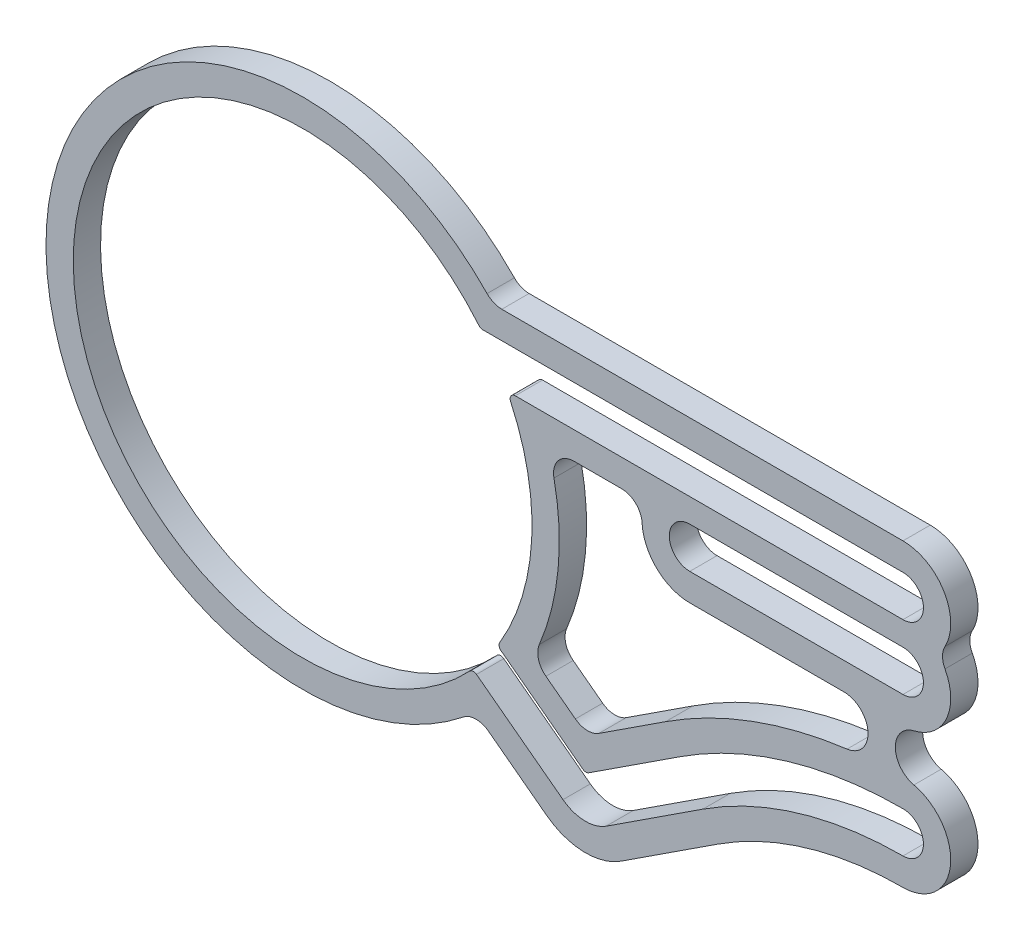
ISO-10303-21;
HEADER;
FILE_DESCRIPTION(('STEP AP214'),'2;1');
FILE_NAME('part.step','',(''),(''),'','','');
FILE_SCHEMA(('AUTOMOTIVE_DESIGN { 1 0 10303 214 1 1 1 1 }'));
ENDSEC;
DATA;
#1=APPLICATION_CONTEXT('core data for automotive mechanical design processes');
#2=APPLICATION_PROTOCOL_DEFINITION('international standard','automotive_design',2000,#1);
#3=PRODUCT_CONTEXT('',#1,'mechanical');
#4=PRODUCT('Part','Part','',(#3));
#5=PRODUCT_RELATED_PRODUCT_CATEGORY('part','',(#4));
#6=PRODUCT_DEFINITION_FORMATION('','',#4);
#7=PRODUCT_DEFINITION_CONTEXT('part definition',#1,'design');
#8=PRODUCT_DEFINITION('design','',#6,#7);
#9=PRODUCT_DEFINITION_SHAPE('','',#8);
#10=(LENGTH_UNIT() NAMED_UNIT(*) SI_UNIT(.MILLI.,.METRE.));
#11=(NAMED_UNIT(*) PLANE_ANGLE_UNIT() SI_UNIT($,.RADIAN.));
#12=(NAMED_UNIT(*) SI_UNIT($,.STERADIAN.) SOLID_ANGLE_UNIT());
#13=UNCERTAINTY_MEASURE_WITH_UNIT(LENGTH_MEASURE(1.E-05),#10,'distance_accuracy_value','');
#14=(GEOMETRIC_REPRESENTATION_CONTEXT(3) GLOBAL_UNCERTAINTY_ASSIGNED_CONTEXT((#13)) GLOBAL_UNIT_ASSIGNED_CONTEXT((#10,
#11,#12)) REPRESENTATION_CONTEXT('',''));
#15=CARTESIAN_POINT('',(0.,0.,0.));
#16=DIRECTION('',(0.,0.,1.));
#17=DIRECTION('',(1.,0.,0.));
#18=AXIS2_PLACEMENT_3D('',#15,#16,#17);
#19=CARTESIAN_POINT('',(55.5,-104.368840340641,-3.));
#20=DIRECTION('',(0.,0.,-1.));
#21=DIRECTION('',(-1.,0.,0.));
#22=AXIS2_PLACEMENT_3D('',#19,#20,#21);
#23=PLANE('',#22);
#24=CARTESIAN_POINT('',(55.5,-104.368840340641,-3.));
#25=DIRECTION('',(0.,0.,1.));
#26=DIRECTION('',(-1.,0.,0.));
#27=AXIS2_PLACEMENT_3D('',#24,#25,#26);
#28=CIRCLE('',#27,19.8688403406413);
#29=CARTESIAN_POINT('',(55.5,-84.5,-3.));
#30=VERTEX_POINT('',#29);
#31=CARTESIAN_POINT('',(44.6414465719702,-87.7296506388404,-3.));
#32=VERTEX_POINT('',#31);
#33=EDGE_CURVE('E591',#30,#32,#28,.T.);
#34=ORIENTED_EDGE('',*,*,#33,.T.);
#35=DIRECTION('',(-0.837451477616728,-0.546511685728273,0.));
#36=VECTOR('',#35,1.);
#37=CARTESIAN_POINT('',(44.6414465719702,-87.7296506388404,-3.));
#38=LINE('',#37,#36);
#39=CARTESIAN_POINT('',(38.9676387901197,-91.4323156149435,-3.));
#40=VERTEX_POINT('',#39);
#41=EDGE_CURVE('E594',#32,#40,#38,.T.);
#42=ORIENTED_EDGE('',*,*,#41,.T.);
#43=CARTESIAN_POINT('',(36.8908943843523,-88.25,-3.));
#44=DIRECTION('',(0.,0.,-1.));
#45=DIRECTION('',(-1.,0.,0.));
#46=AXIS2_PLACEMENT_3D('',#43,#44,#45);
#47=CIRCLE('',#46,3.80000000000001);
#48=CARTESIAN_POINT('',(34.6039972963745,-91.2848149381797,-3.));
#49=VERTEX_POINT('',#48);
#50=EDGE_CURVE('E597',#40,#49,#47,.T.);
#51=ORIENTED_EDGE('',*,*,#50,.T.);
#52=DIRECTION('',(-0.798635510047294,0.601815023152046,0.));
#53=VECTOR('',#52,1.);
#54=CARTESIAN_POINT('',(34.6039972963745,-91.2848149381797,-3.));
#55=LINE('',#54,#53);
#56=CARTESIAN_POINT('',(31.1934272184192,-88.7147660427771,-3.));
#57=VERTEX_POINT('',#56);
#58=EDGE_CURVE('E599',#49,#57,#55,.T.);
#59=ORIENTED_EDGE('',*,*,#58,.T.);
#60=CARTESIAN_POINT('',(30.4712491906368,-89.6731286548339,-3.));
#61=DIRECTION('',(0.,0.,1.));
#62=DIRECTION('',(-1.,0.,0.));
#63=AXIS2_PLACEMENT_3D('',#60,#61,#62);
#64=CIRCLE('',#63,1.2);
#65=CARTESIAN_POINT('',(29.7201415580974,-88.7372668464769,-3.));
#66=VERTEX_POINT('',#65);
#67=EDGE_CURVE('E601',#57,#66,#64,.T.);
#68=ORIENTED_EDGE('',*,*,#67,.T.);
#69=CARTESIAN_POINT('',(20.3,-77.,-3.));
#70=DIRECTION('',(0.,0.,-1.));
#71=DIRECTION('',(-1.,0.,0.));
#72=AXIS2_PLACEMENT_3D('',#69,#70,#71);
#73=CIRCLE('',#72,15.05);
#74=CARTESIAN_POINT('',(31.1154983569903,-66.5344615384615,-3.));
#75=VERTEX_POINT('',#74);
#76=EDGE_CURVE('E603',#66,#75,#73,.T.);
#77=ORIENTED_EDGE('',*,*,#76,.T.);
#78=CARTESIAN_POINT('',(31.9778636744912,-65.7,-3.));
#79=DIRECTION('',(0.,0.,1.));
#80=DIRECTION('',(-1.,0.,0.));
#81=AXIS2_PLACEMENT_3D('',#78,#79,#80);
#82=CIRCLE('',#81,1.19999999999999);
#83=CARTESIAN_POINT('',(31.9778636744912,-66.9,-3.));
#84=VERTEX_POINT('',#83);
#85=EDGE_CURVE('E605',#75,#84,#82,.T.);
#86=ORIENTED_EDGE('',*,*,#85,.T.);
#87=DIRECTION('',(1.,0.,0.));
#88=VECTOR('',#87,1.);
#89=CARTESIAN_POINT('',(31.9778636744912,-66.9,-3.));
#90=LINE('',#89,#88);
#91=CARTESIAN_POINT('',(55.5,-66.9,-3.));
#92=VERTEX_POINT('',#91);
#93=EDGE_CURVE('E607',#84,#92,#90,.T.);
#94=ORIENTED_EDGE('',*,*,#93,.T.);
#95=CARTESIAN_POINT('',(55.5,-69.7,-3.));
#96=DIRECTION('',(0.,0.,-1.));
#97=DIRECTION('',(-1.,0.,0.));
#98=AXIS2_PLACEMENT_3D('',#95,#96,#97);
#99=CIRCLE('',#98,2.80000000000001);
#100=CARTESIAN_POINT('',(57.9639602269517,-71.03,-3.));
#101=VERTEX_POINT('',#100);
#102=EDGE_CURVE('E609',#92,#101,#99,.T.);
#103=ORIENTED_EDGE('',*,*,#102,.T.);
#104=CARTESIAN_POINT('',(59.0199431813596,-71.6,-3.));
#105=DIRECTION('',(0.,0.,1.));
#106=DIRECTION('',(-1.,0.,0.));
#107=AXIS2_PLACEMENT_3D('',#104,#105,#106);
#108=CIRCLE('',#107,1.19999999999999);
#109=CARTESIAN_POINT('',(57.9639602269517,-72.17,-3.));
#110=VERTEX_POINT('',#109);
#111=EDGE_CURVE('E611',#101,#110,#108,.T.);
#112=ORIENTED_EDGE('',*,*,#111,.T.);
#113=CARTESIAN_POINT('',(55.5,-73.5,-3.));
#114=DIRECTION('',(0.,0.,-1.));
#115=DIRECTION('',(-1.,0.,0.));
#116=AXIS2_PLACEMENT_3D('',#113,#114,#115);
#117=CIRCLE('',#116,2.8);
#118=CARTESIAN_POINT('',(56.1408075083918,-76.2256862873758,-3.));
#119=VERTEX_POINT('',#118);
#120=EDGE_CURVE('E613',#110,#119,#117,.T.);
#121=ORIENTED_EDGE('',*,*,#120,.T.);
#122=CARTESIAN_POINT('',(56.4639079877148,-77.6,-3.));
#123=DIRECTION('',(0.,0.,1.));
#124=DIRECTION('',(-1.,0.,0.));
#125=AXIS2_PLACEMENT_3D('',#122,#123,#124);
#126=CIRCLE('',#125,1.41178330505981);
#127=CARTESIAN_POINT('',(56.1408075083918,-78.9743137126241,-3.));
#128=VERTEX_POINT('',#127);
#129=EDGE_CURVE('E615',#119,#128,#126,.T.);
#130=ORIENTED_EDGE('',*,*,#129,.T.);
#131=CARTESIAN_POINT('',(55.5,-81.7,-3.));
#132=DIRECTION('',(0.,0.,-1.));
#133=DIRECTION('',(-1.,0.,0.));
#134=AXIS2_PLACEMENT_3D('',#131,#132,#133);
#135=CIRCLE('',#134,2.79999999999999);
#136=EDGE_CURVE('E617',#128,#30,#135,.T.);
#137=ORIENTED_EDGE('',*,*,#136,.T.);
#138=EDGE_LOOP('',(#34,#42,#51,#59,#68,#77,#86,#94,#103,#112,#121,#130,#137));
#139=FACE_BOUND('',#138,.T.);
#140=CARTESIAN_POINT('',(55.5,-104.368840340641,-3.));
#141=DIRECTION('',(0.,0.,1.));
#142=DIRECTION('',(-1.,0.,0.));
#143=AXIS2_PLACEMENT_3D('',#140,#141,#142);
#144=CIRCLE('',#143,21.4688403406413);
#145=CARTESIAN_POINT('',(55.5,-82.9,-3.));
#146=VERTEX_POINT('',#145);
#147=CARTESIAN_POINT('',(43.7670278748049,-86.3897282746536,-3.));
#148=VERTEX_POINT('',#147);
#149=EDGE_CURVE('E464',#146,#148,#144,.T.);
#150=ORIENTED_EDGE('',*,*,#149,.F.);
#151=CARTESIAN_POINT('',(55.5,-81.7,-3.));
#152=DIRECTION('',(0.,0.,-1.));
#153=DIRECTION('',(-1.,0.,0.));
#154=AXIS2_PLACEMENT_3D('',#151,#152,#153);
#155=CIRCLE('',#154,1.19999999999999);
#156=CARTESIAN_POINT('',(55.5,-80.5,-3.));
#157=VERTEX_POINT('',#156);
#158=EDGE_CURVE('E462',#157,#146,#155,.T.);
#159=ORIENTED_EDGE('',*,*,#158,.F.);
#160=CARTESIAN_POINT('',(55.5,-104.368840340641,-3.));
#161=DIRECTION('',(0.,0.,-1.));
#162=DIRECTION('',(-1.,0.,0.));
#163=AXIS2_PLACEMENT_3D('',#160,#161,#162);
#164=CIRCLE('',#163,23.8688403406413);
#165=CARTESIAN_POINT('',(42.4553998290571,-84.3798447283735,-3.));
#166=VERTEX_POINT('',#165);
#167=EDGE_CURVE('E498',#166,#157,#164,.T.);
#168=ORIENTED_EDGE('',*,*,#167,.F.);
#169=DIRECTION('',(0.837451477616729,0.546511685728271,0.));
#170=VECTOR('',#169,1.);
#171=CARTESIAN_POINT('',(37.0754847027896,-87.8907185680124,-3.));
#172=LINE('',#171,#170);
#173=CARTESIAN_POINT('',(37.0754847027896,-87.8907185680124,-3.));
#174=VERTEX_POINT('',#173);
#175=EDGE_CURVE('E495',#174,#166,#172,.T.);
#176=ORIENTED_EDGE('',*,*,#175,.F.);
#177=CARTESIAN_POINT('',(36.9115311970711,-87.6394831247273,-3.));
#178=DIRECTION('',(0.,0.,1.));
#179=DIRECTION('',(-1.,0.,0.));
#180=AXIS2_PLACEMENT_3D('',#177,#178,#179);
#181=CIRCLE('',#180,0.300000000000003);
#182=CARTESIAN_POINT('',(36.7309866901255,-87.8790737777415,-3.));
#183=VERTEX_POINT('',#182);
#184=EDGE_CURVE('E493',#183,#174,#181,.T.);
#185=ORIENTED_EDGE('',*,*,#184,.F.);
#186=DIRECTION('',(0.798635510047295,-0.601815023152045,0.));
#187=VECTOR('',#186,1.);
#188=CARTESIAN_POINT('',(31.9378778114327,-84.267207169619,-3.));
#189=LINE('',#188,#187);
#190=CARTESIAN_POINT('',(31.9378778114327,-84.267207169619,-3.));
#191=VERTEX_POINT('',#190);
#192=EDGE_CURVE('E491',#191,#183,#189,.T.);
#193=ORIENTED_EDGE('',*,*,#192,.F.);
#194=CARTESIAN_POINT('',(32.1184223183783,-84.0276165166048,-3.));
#195=DIRECTION('',(0.,0.,1.));
#196=DIRECTION('',(-1.,0.,0.));
#197=AXIS2_PLACEMENT_3D('',#194,#195,#196);
#198=CIRCLE('',#197,0.300000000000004);
#199=CARTESIAN_POINT('',(31.8605658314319,-83.8742867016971,-3.));
#200=VERTEX_POINT('',#199);
#201=EDGE_CURVE('E489',#200,#191,#198,.T.);
#202=ORIENTED_EDGE('',*,*,#201,.F.);
#203=CARTESIAN_POINT('',(20.3,-77.,-3.));
#204=DIRECTION('',(0.,0.,-1.));
#205=DIRECTION('',(-1.,0.,0.));
#206=AXIS2_PLACEMENT_3D('',#203,#204,#205);
#207=CIRCLE('',#206,13.45);
#208=CARTESIAN_POINT('',(32.4948519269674,-71.3265454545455,-3.));
#209=VERTEX_POINT('',#208);
#210=EDGE_CURVE('E487',#209,#200,#207,.T.);
#211=ORIENTED_EDGE('',*,*,#210,.F.);
#212=CARTESIAN_POINT('',(32.7668560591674,-71.2,-3.));
#213=DIRECTION('',(0.,0.,1.));
#214=DIRECTION('',(-1.,0.,0.));
#215=AXIS2_PLACEMENT_3D('',#212,#213,#214);
#216=CIRCLE('',#215,0.299999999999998);
#217=CARTESIAN_POINT('',(32.7668560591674,-70.9,-3.));
#218=VERTEX_POINT('',#217);
#219=EDGE_CURVE('E485',#218,#209,#216,.T.);
#220=ORIENTED_EDGE('',*,*,#219,.F.);
#221=DIRECTION('',(-1.,0.,0.));
#222=VECTOR('',#221,1.);
#223=CARTESIAN_POINT('',(55.5,-70.9,-3.));
#224=LINE('',#223,#222);
#225=CARTESIAN_POINT('',(55.5,-70.9,-3.));
#226=VERTEX_POINT('',#225);
#227=EDGE_CURVE('E483',#226,#218,#224,.T.);
#228=ORIENTED_EDGE('',*,*,#227,.F.);
#229=CARTESIAN_POINT('',(55.5,-69.7,-3.));
#230=DIRECTION('',(0.,0.,-1.));
#231=DIRECTION('',(-1.,0.,0.));
#232=AXIS2_PLACEMENT_3D('',#229,#230,#231);
#233=CIRCLE('',#232,1.20000000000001);
#234=CARTESIAN_POINT('',(55.5,-68.5,-3.));
#235=VERTEX_POINT('',#234);
#236=EDGE_CURVE('E481',#235,#226,#233,.T.);
#237=ORIENTED_EDGE('',*,*,#236,.F.);
#238=DIRECTION('',(1.,0.,0.));
#239=VECTOR('',#238,1.);
#240=CARTESIAN_POINT('',(30.8651549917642,-68.5,-3.));
#241=LINE('',#240,#239);
#242=CARTESIAN_POINT('',(30.8651549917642,-68.5,-3.));
#243=VERTEX_POINT('',#242);
#244=EDGE_CURVE('E479',#243,#235,#241,.T.);
#245=ORIENTED_EDGE('',*,*,#244,.F.);
#246=CARTESIAN_POINT('',(30.8651549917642,-68.2,-3.));
#247=DIRECTION('',(0.,0.,1.));
#248=DIRECTION('',(-1.,0.,0.));
#249=AXIS2_PLACEMENT_3D('',#246,#247,#248);
#250=CIRCLE('',#249,0.299999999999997);
#251=CARTESIAN_POINT('',(30.6346425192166,-68.392,-3.));
#252=VERTEX_POINT('',#251);
#253=EDGE_CURVE('E477',#252,#243,#250,.T.);
#254=ORIENTED_EDGE('',*,*,#253,.F.);
#255=CARTESIAN_POINT('',(20.3,-77.,-3.));
#256=DIRECTION('',(0.,0.,-1.));
#257=DIRECTION('',(-1.,0.,0.));
#258=AXIS2_PLACEMENT_3D('',#255,#256,#257);
#259=CIRCLE('',#258,13.45);
#260=CARTESIAN_POINT('',(30.0945122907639,-86.217918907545,-3.));
#261=VERTEX_POINT('',#260);
#262=EDGE_CURVE('E475',#261,#252,#259,.T.);
#263=ORIENTED_EDGE('',*,*,#262,.F.);
#264=CARTESIAN_POINT('',(30.3129772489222,-86.4235230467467,-3.));
#265=DIRECTION('',(0.,0.,1.));
#266=DIRECTION('',(-1.,0.,0.));
#267=AXIS2_PLACEMENT_3D('',#264,#265,#266);
#268=CIRCLE('',#267,0.3);
#269=CARTESIAN_POINT('',(30.4935217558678,-86.1839323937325,-3.));
#270=VERTEX_POINT('',#269);
#271=EDGE_CURVE('E473',#270,#261,#268,.T.);
#272=ORIENTED_EDGE('',*,*,#271,.F.);
#273=DIRECTION('',(-0.798635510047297,0.601815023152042,0.));
#274=VECTOR('',#273,1.);
#275=CARTESIAN_POINT('',(35.5669013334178,-90.006998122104,-3.));
#276=LINE('',#275,#274);
#277=CARTESIAN_POINT('',(35.5669013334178,-90.006998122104,-3.));
#278=VERTEX_POINT('',#277);
#279=EDGE_CURVE('E471',#278,#270,#276,.T.);
#280=ORIENTED_EDGE('',*,*,#279,.F.);
#281=CARTESIAN_POINT('',(36.8908943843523,-88.25,-3.));
#282=DIRECTION('',(0.,0.,-1.));
#283=DIRECTION('',(-1.,0.,0.));
#284=AXIS2_PLACEMENT_3D('',#281,#282,#283);
#285=CIRCLE('',#284,2.19999999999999);
#286=CARTESIAN_POINT('',(38.0932200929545,-90.0923932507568,-3.));
#287=VERTEX_POINT('',#286);
#288=EDGE_CURVE('E469',#287,#278,#285,.T.);
#289=ORIENTED_EDGE('',*,*,#288,.F.);
#290=DIRECTION('',(-0.837451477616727,-0.546511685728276,0.));
#291=VECTOR('',#290,1.);
#292=CARTESIAN_POINT('',(43.7670278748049,-86.3897282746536,-3.));
#293=LINE('',#292,#291);
#294=EDGE_CURVE('E467',#148,#287,#293,.T.);
#295=ORIENTED_EDGE('',*,*,#294,.F.);
#296=EDGE_LOOP('',(#150,#159,#168,#176,#185,#193,#202,#211,#220,#228,#237,#245,#254,#263,#272,
#280,#289,#295));
#297=FACE_BOUND('',#296,.T.);
#298=DIRECTION('',(1.,0.,0.));
#299=VECTOR('',#298,1.);
#300=CARTESIAN_POINT('',(43.,-72.3,-3.));
#301=LINE('',#300,#299);
#302=CARTESIAN_POINT('',(43.,-72.3,-3.));
#303=VERTEX_POINT('',#302);
#304=CARTESIAN_POINT('',(55.5,-72.3,-3.));
#305=VERTEX_POINT('',#304);
#306=EDGE_CURVE('E433',#303,#305,#301,.T.);
#307=ORIENTED_EDGE('',*,*,#306,.F.);
#308=CARTESIAN_POINT('',(43.,-73.5,-3.));
#309=DIRECTION('',(0.,0.,-1.));
#310=DIRECTION('',(-1.,0.,0.));
#311=AXIS2_PLACEMENT_3D('',#308,#309,#310);
#312=CIRCLE('',#311,1.19999999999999);
#313=CARTESIAN_POINT('',(43.,-74.7,-3.));
#314=VERTEX_POINT('',#313);
#315=EDGE_CURVE('E431',#314,#303,#312,.T.);
#316=ORIENTED_EDGE('',*,*,#315,.F.);
#317=DIRECTION('',(-1.,0.,0.));
#318=VECTOR('',#317,1.);
#319=CARTESIAN_POINT('',(55.5,-74.7,-3.));
#320=LINE('',#319,#318);
#321=CARTESIAN_POINT('',(55.5,-74.7,-3.));
#322=VERTEX_POINT('',#321);
#323=EDGE_CURVE('E439',#322,#314,#320,.T.);
#324=ORIENTED_EDGE('',*,*,#323,.F.);
#325=CARTESIAN_POINT('',(55.5,-73.5,-3.));
#326=DIRECTION('',(0.,0.,-1.));
#327=DIRECTION('',(-1.,0.,0.));
#328=AXIS2_PLACEMENT_3D('',#325,#326,#327);
#329=CIRCLE('',#328,1.20000000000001);
#330=EDGE_CURVE('E436',#305,#322,#329,.T.);
#331=ORIENTED_EDGE('',*,*,#330,.F.);
#332=EDGE_LOOP('',(#307,#316,#324,#331));
#333=FACE_BOUND('',#332,.T.);
#334=DIRECTION('',(-0.837451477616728,-0.546511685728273,0.));
#335=VECTOR('',#334,1.);
#336=CARTESIAN_POINT('',(41.5809811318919,-83.0399223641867,-3.));
#337=LINE('',#336,#335);
#338=CARTESIAN_POINT('',(41.5809811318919,-83.0399223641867,-3.));
#339=VERTEX_POINT('',#338);
#340=CARTESIAN_POINT('',(37.6705292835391,-85.5918405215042,-3.));
#341=VERTEX_POINT('',#340);
#342=EDGE_CURVE('E346',#339,#341,#337,.T.);
#343=ORIENTED_EDGE('',*,*,#342,.F.);
#344=CARTESIAN_POINT('',(55.5,-104.368840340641,-3.));
#345=DIRECTION('',(0.,0.,1.));
#346=DIRECTION('',(-1.,0.,0.));
#347=AXIS2_PLACEMENT_3D('',#344,#345,#346);
#348=CIRCLE('',#347,25.4688403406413);
#349=CARTESIAN_POINT('',(52.2220443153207,-79.1118247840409,-3.));
#350=VERTEX_POINT('',#349);
#351=EDGE_CURVE('E338',#350,#339,#348,.T.);
#352=ORIENTED_EDGE('',*,*,#351,.F.);
#353=CARTESIAN_POINT('',(52.0403413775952,-77.7117833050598,-3.));
#354=DIRECTION('',(0.,0.,-1.));
#355=DIRECTION('',(-1.,0.,0.));
#356=AXIS2_PLACEMENT_3D('',#353,#354,#355);
#357=CIRCLE('',#356,1.41178330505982);
#358=CARTESIAN_POINT('',(52.0403413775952,-76.3,-3.));
#359=VERTEX_POINT('',#358);
#360=EDGE_CURVE('E379',#359,#350,#357,.T.);
#361=ORIENTED_EDGE('',*,*,#360,.F.);
#362=DIRECTION('',(1.,0.,0.));
#363=VECTOR('',#362,1.);
#364=CARTESIAN_POINT('',(43.,-76.3,-3.));
#365=LINE('',#364,#363);
#366=CARTESIAN_POINT('',(43.,-76.3,-3.));
#367=VERTEX_POINT('',#366);
#368=EDGE_CURVE('E377',#367,#359,#365,.T.);
#369=ORIENTED_EDGE('',*,*,#368,.F.);
#370=CARTESIAN_POINT('',(43.,-73.5,-3.));
#371=DIRECTION('',(0.,0.,1.));
#372=DIRECTION('',(-1.,0.,0.));
#373=AXIS2_PLACEMENT_3D('',#370,#371,#372);
#374=CIRCLE('',#373,2.79999999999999);
#375=CARTESIAN_POINT('',(40.2035021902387,-73.64,-3.));
#376=VERTEX_POINT('',#375);
#377=EDGE_CURVE('E375',#376,#367,#374,.T.);
#378=ORIENTED_EDGE('',*,*,#377,.F.);
#379=CARTESIAN_POINT('',(39.0050031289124,-73.7,-3.));
#380=DIRECTION('',(0.,0.,-1.));
#381=DIRECTION('',(-1.,0.,0.));
#382=AXIS2_PLACEMENT_3D('',#379,#380,#381);
#383=CIRCLE('',#382,1.2);
#384=CARTESIAN_POINT('',(39.0050031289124,-72.5,-3.));
#385=VERTEX_POINT('',#384);
#386=EDGE_CURVE('E373',#385,#376,#383,.T.);
#387=ORIENTED_EDGE('',*,*,#386,.F.);
#388=DIRECTION('',(1.,0.,0.));
#389=VECTOR('',#388,1.);
#390=CARTESIAN_POINT('',(36.2113952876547,-72.5,-3.));
#391=LINE('',#390,#389);
#392=CARTESIAN_POINT('',(36.2113952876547,-72.5,-3.));
#393=VERTEX_POINT('',#392);
#394=EDGE_CURVE('E371',#393,#385,#391,.T.);
#395=ORIENTED_EDGE('',*,*,#394,.F.);
#396=CARTESIAN_POINT('',(36.2113952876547,-73.7,-3.));
#397=DIRECTION('',(0.,0.,-1.));
#398=DIRECTION('',(-1.,0.,0.));
#399=AXIS2_PLACEMENT_3D('',#396,#397,#398);
#400=CIRCLE('',#399,1.19999999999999);
#401=CARTESIAN_POINT('',(35.0363999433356,-73.9436923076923,-3.));
#402=VERTEX_POINT('',#401);
#403=EDGE_CURVE('E369',#402,#393,#400,.T.);
#404=ORIENTED_EDGE('',*,*,#403,.F.);
#405=CARTESIAN_POINT('',(20.3,-77.,-3.));
#406=DIRECTION('',(0.,0.,1.));
#407=DIRECTION('',(-1.,0.,0.));
#408=AXIS2_PLACEMENT_3D('',#405,#406,#407);
#409=CIRCLE('',#408,15.05);
#410=CARTESIAN_POINT('',(34.1791279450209,-82.8199920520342,-3.));
#411=VERTEX_POINT('',#410);
#412=EDGE_CURVE('E367',#411,#402,#409,.T.);
#413=ORIENTED_EDGE('',*,*,#412,.F.);
#414=CARTESIAN_POINT('',(35.2857693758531,-83.2840445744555,-3.));
#415=DIRECTION('',(0.,0.,-1.));
#416=DIRECTION('',(-1.,0.,0.));
#417=AXIS2_PLACEMENT_3D('',#414,#415,#416);
#418=CIRCLE('',#417,1.2);
#419=CARTESIAN_POINT('',(34.5635913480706,-84.2424071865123,-3.));
#420=VERTEX_POINT('',#419);
#421=EDGE_CURVE('E365',#420,#411,#418,.T.);
#422=ORIENTED_EDGE('',*,*,#421,.F.);
#423=DIRECTION('',(-0.798635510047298,0.601815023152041,0.));
#424=VECTOR('',#423,1.);
#425=CARTESIAN_POINT('',(36.2925372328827,-85.5452613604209,-3.));
#426=LINE('',#425,#424);
#427=CARTESIAN_POINT('',(36.2925372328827,-85.5452613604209,-3.));
#428=VERTEX_POINT('',#427);
#429=EDGE_CURVE('E361',#428,#420,#426,.T.);
#430=ORIENTED_EDGE('',*,*,#429,.F.);
#431=CARTESIAN_POINT('',(37.0147152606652,-84.5868987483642,-3.));
#432=DIRECTION('',(0.,0.,-1.));
#433=DIRECTION('',(-1.,0.,0.));
#434=AXIS2_PLACEMENT_3D('',#431,#432,#433);
#435=CIRCLE('',#434,1.2);
#436=EDGE_CURVE('E359',#341,#428,#435,.T.);
#437=ORIENTED_EDGE('',*,*,#436,.F.);
#438=EDGE_LOOP('',(#343,#352,#361,#369,#378,#387,#395,#404,#413,#422,#430,#437));
#439=FACE_BOUND('',#438,.T.);
#440=ADVANCED_FACE('F39',(#139,#297,#333,#439),#23,.T.);
#441=CARTESIAN_POINT('',(55.5,-104.368840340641,-1.4));
#442=DIRECTION('',(0.,0.,-1.));
#443=DIRECTION('',(-1.,0.,0.));
#444=AXIS2_PLACEMENT_3D('',#441,#442,#443);
#445=PLANE('',#444);
#446=CARTESIAN_POINT('',(43.,-73.5,-1.4));
#447=DIRECTION('',(0.,0.,-1.));
#448=DIRECTION('',(-1.,0.,0.));
#449=AXIS2_PLACEMENT_3D('',#446,#447,#448);
#450=CIRCLE('',#449,1.19999999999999);
#451=CARTESIAN_POINT('',(43.,-74.7,-1.4));
#452=VERTEX_POINT('',#451);
#453=CARTESIAN_POINT('',(43.,-72.3,-1.4));
#454=VERTEX_POINT('',#453);
#455=EDGE_CURVE('E354',#452,#454,#450,.T.);
#456=ORIENTED_EDGE('',*,*,#455,.T.);
#457=DIRECTION('',(1.,0.,0.));
#458=VECTOR('',#457,1.);
#459=CARTESIAN_POINT('',(43.,-72.3,-1.4));
#460=LINE('',#459,#458);
#461=CARTESIAN_POINT('',(55.5,-72.3,-1.4));
#462=VERTEX_POINT('',#461);
#463=EDGE_CURVE('E444',#454,#462,#460,.T.);
#464=ORIENTED_EDGE('',*,*,#463,.T.);
#465=CARTESIAN_POINT('',(55.5,-73.5,-1.4));
#466=DIRECTION('',(0.,0.,-1.));
#467=DIRECTION('',(-1.,0.,0.));
#468=AXIS2_PLACEMENT_3D('',#465,#466,#467);
#469=CIRCLE('',#468,1.20000000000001);
#470=CARTESIAN_POINT('',(55.5,-74.7,-1.4));
#471=VERTEX_POINT('',#470);
#472=EDGE_CURVE('E447',#462,#471,#469,.T.);
#473=ORIENTED_EDGE('',*,*,#472,.T.);
#474=DIRECTION('',(-1.,0.,0.));
#475=VECTOR('',#474,1.);
#476=CARTESIAN_POINT('',(55.5,-74.7,-1.4));
#477=LINE('',#476,#475);
#478=EDGE_CURVE('E434',#471,#452,#477,.T.);
#479=ORIENTED_EDGE('',*,*,#478,.T.);
#480=EDGE_LOOP('',(#456,#464,#473,#479));
#481=FACE_BOUND('',#480,.T.);
#482=CARTESIAN_POINT('',(55.5,-104.368840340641,-1.4));
#483=DIRECTION('',(0.,0.,1.));
#484=DIRECTION('',(-1.,0.,0.));
#485=AXIS2_PLACEMENT_3D('',#482,#483,#484);
#486=CIRCLE('',#485,19.8688403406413);
#487=CARTESIAN_POINT('',(55.5,-84.5,-1.4));
#488=VERTEX_POINT('',#487);
#489=CARTESIAN_POINT('',(44.6414465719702,-87.7296506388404,-1.4));
#490=VERTEX_POINT('',#489);
#491=EDGE_CURVE('E590',#488,#490,#486,.T.);
#492=ORIENTED_EDGE('',*,*,#491,.F.);
#493=CARTESIAN_POINT('',(55.5,-81.7,-1.4));
#494=DIRECTION('',(0.,0.,-1.));
#495=DIRECTION('',(-1.,0.,0.));
#496=AXIS2_PLACEMENT_3D('',#493,#494,#495);
#497=CIRCLE('',#496,2.79999999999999);
#498=CARTESIAN_POINT('',(56.1408075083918,-78.9743137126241,-1.4));
#499=VERTEX_POINT('',#498);
#500=EDGE_CURVE('E595',#499,#488,#497,.T.);
#501=ORIENTED_EDGE('',*,*,#500,.F.);
#502=CARTESIAN_POINT('',(56.4639079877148,-77.6,-1.4));
#503=DIRECTION('',(0.,0.,1.));
#504=DIRECTION('',(-1.,0.,0.));
#505=AXIS2_PLACEMENT_3D('',#502,#503,#504);
#506=CIRCLE('',#505,1.41178330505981);
#507=CARTESIAN_POINT('',(56.1408075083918,-76.2256862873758,-1.4));
#508=VERTEX_POINT('',#507);
#509=EDGE_CURVE('E642',#508,#499,#506,.T.);
#510=ORIENTED_EDGE('',*,*,#509,.F.);
#511=CARTESIAN_POINT('',(55.5,-73.5,-1.4));
#512=DIRECTION('',(0.,0.,-1.));
#513=DIRECTION('',(-1.,0.,0.));
#514=AXIS2_PLACEMENT_3D('',#511,#512,#513);
#515=CIRCLE('',#514,2.8);
#516=CARTESIAN_POINT('',(57.9639602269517,-72.17,-1.4));
#517=VERTEX_POINT('',#516);
#518=EDGE_CURVE('E640',#517,#508,#515,.T.);
#519=ORIENTED_EDGE('',*,*,#518,.F.);
#520=CARTESIAN_POINT('',(59.0199431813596,-71.6,-1.4));
#521=DIRECTION('',(0.,0.,1.));
#522=DIRECTION('',(-1.,0.,0.));
#523=AXIS2_PLACEMENT_3D('',#520,#521,#522);
#524=CIRCLE('',#523,1.19999999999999);
#525=CARTESIAN_POINT('',(57.9639602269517,-71.03,-1.4));
#526=VERTEX_POINT('',#525);
#527=EDGE_CURVE('E638',#526,#517,#524,.T.);
#528=ORIENTED_EDGE('',*,*,#527,.F.);
#529=CARTESIAN_POINT('',(55.5,-69.7,-1.4));
#530=DIRECTION('',(0.,0.,-1.));
#531=DIRECTION('',(-1.,0.,0.));
#532=AXIS2_PLACEMENT_3D('',#529,#530,#531);
#533=CIRCLE('',#532,2.80000000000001);
#534=CARTESIAN_POINT('',(55.5,-66.9,-1.4));
#535=VERTEX_POINT('',#534);
#536=EDGE_CURVE('E636',#535,#526,#533,.T.);
#537=ORIENTED_EDGE('',*,*,#536,.F.);
#538=DIRECTION('',(1.,0.,0.));
#539=VECTOR('',#538,1.);
#540=CARTESIAN_POINT('',(31.9778636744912,-66.9,-1.4));
#541=LINE('',#540,#539);
#542=CARTESIAN_POINT('',(31.9778636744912,-66.9,-1.4));
#543=VERTEX_POINT('',#542);
#544=EDGE_CURVE('E634',#543,#535,#541,.T.);
#545=ORIENTED_EDGE('',*,*,#544,.F.);
#546=CARTESIAN_POINT('',(31.9778636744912,-65.7,-1.4));
#547=DIRECTION('',(0.,0.,1.));
#548=DIRECTION('',(-1.,0.,0.));
#549=AXIS2_PLACEMENT_3D('',#546,#547,#548);
#550=CIRCLE('',#549,1.19999999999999);
#551=CARTESIAN_POINT('',(31.1154983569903,-66.5344615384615,-1.4));
#552=VERTEX_POINT('',#551);
#553=EDGE_CURVE('E632',#552,#543,#550,.T.);
#554=ORIENTED_EDGE('',*,*,#553,.F.);
#555=CARTESIAN_POINT('',(20.3,-77.,-1.4));
#556=DIRECTION('',(0.,0.,-1.));
#557=DIRECTION('',(-1.,0.,0.));
#558=AXIS2_PLACEMENT_3D('',#555,#556,#557);
#559=CIRCLE('',#558,15.05);
#560=CARTESIAN_POINT('',(29.7201415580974,-88.7372668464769,-1.4));
#561=VERTEX_POINT('',#560);
#562=EDGE_CURVE('E630',#561,#552,#559,.T.);
#563=ORIENTED_EDGE('',*,*,#562,.F.);
#564=CARTESIAN_POINT('',(30.4712491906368,-89.6731286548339,-1.4));
#565=DIRECTION('',(0.,0.,1.));
#566=DIRECTION('',(-1.,0.,0.));
#567=AXIS2_PLACEMENT_3D('',#564,#565,#566);
#568=CIRCLE('',#567,1.2);
#569=CARTESIAN_POINT('',(31.1934272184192,-88.7147660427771,-1.4));
#570=VERTEX_POINT('',#569);
#571=EDGE_CURVE('E628',#570,#561,#568,.T.);
#572=ORIENTED_EDGE('',*,*,#571,.F.);
#573=DIRECTION('',(-0.798635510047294,0.601815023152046,0.));
#574=VECTOR('',#573,1.);
#575=CARTESIAN_POINT('',(34.6039972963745,-91.2848149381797,-1.4));
#576=LINE('',#575,#574);
#577=CARTESIAN_POINT('',(34.6039972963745,-91.2848149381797,-1.4));
#578=VERTEX_POINT('',#577);
#579=EDGE_CURVE('E626',#578,#570,#576,.T.);
#580=ORIENTED_EDGE('',*,*,#579,.F.);
#581=CARTESIAN_POINT('',(36.8908943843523,-88.25,-1.4));
#582=DIRECTION('',(0.,0.,-1.));
#583=DIRECTION('',(-1.,0.,0.));
#584=AXIS2_PLACEMENT_3D('',#581,#582,#583);
#585=CIRCLE('',#584,3.80000000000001);
#586=CARTESIAN_POINT('',(38.9676387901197,-91.4323156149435,-1.4));
#587=VERTEX_POINT('',#586);
#588=EDGE_CURVE('E624',#587,#578,#585,.T.);
#589=ORIENTED_EDGE('',*,*,#588,.F.);
#590=DIRECTION('',(-0.837451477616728,-0.546511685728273,0.));
#591=VECTOR('',#590,1.);
#592=CARTESIAN_POINT('',(44.6414465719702,-87.7296506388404,-1.4));
#593=LINE('',#592,#591);
#594=EDGE_CURVE('E622',#490,#587,#593,.T.);
#595=ORIENTED_EDGE('',*,*,#594,.F.);
#596=EDGE_LOOP('',(#492,#501,#510,#519,#528,#537,#545,#554,#563,#572,#580,#589,#595));
#597=FACE_BOUND('',#596,.T.);
#598=CARTESIAN_POINT('',(55.5,-81.7,-1.4));
#599=DIRECTION('',(0.,0.,-1.));
#600=DIRECTION('',(-1.,0.,0.));
#601=AXIS2_PLACEMENT_3D('',#598,#599,#600);
#602=CIRCLE('',#601,1.19999999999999);
#603=CARTESIAN_POINT('',(55.5,-80.5,-1.4));
#604=VERTEX_POINT('',#603);
#605=CARTESIAN_POINT('',(55.5,-82.9,-1.4));
#606=VERTEX_POINT('',#605);
#607=EDGE_CURVE('E461',#604,#606,#602,.T.);
#608=ORIENTED_EDGE('',*,*,#607,.T.);
#609=CARTESIAN_POINT('',(55.5,-104.368840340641,-1.4));
#610=DIRECTION('',(0.,0.,1.));
#611=DIRECTION('',(-1.,0.,0.));
#612=AXIS2_PLACEMENT_3D('',#609,#610,#611);
#613=CIRCLE('',#612,21.4688403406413);
#614=CARTESIAN_POINT('',(43.7670278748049,-86.3897282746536,-1.4));
#615=VERTEX_POINT('',#614);
#616=EDGE_CURVE('E503',#606,#615,#613,.T.);
#617=ORIENTED_EDGE('',*,*,#616,.T.);
#618=DIRECTION('',(-0.837451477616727,-0.546511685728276,0.));
#619=VECTOR('',#618,1.);
#620=CARTESIAN_POINT('',(43.7670278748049,-86.3897282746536,-1.4));
#621=LINE('',#620,#619);
#622=CARTESIAN_POINT('',(38.0932200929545,-90.0923932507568,-1.4));
#623=VERTEX_POINT('',#622);
#624=EDGE_CURVE('E506',#615,#623,#621,.T.);
#625=ORIENTED_EDGE('',*,*,#624,.T.);
#626=CARTESIAN_POINT('',(36.8908943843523,-88.25,-1.4));
#627=DIRECTION('',(0.,0.,-1.));
#628=DIRECTION('',(-1.,0.,0.));
#629=AXIS2_PLACEMENT_3D('',#626,#627,#628);
#630=CIRCLE('',#629,2.19999999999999);
#631=CARTESIAN_POINT('',(35.5669013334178,-90.006998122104,-1.4));
#632=VERTEX_POINT('',#631);
#633=EDGE_CURVE('E509',#623,#632,#630,.T.);
#634=ORIENTED_EDGE('',*,*,#633,.T.);
#635=DIRECTION('',(-0.798635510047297,0.601815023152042,0.));
#636=VECTOR('',#635,1.);
#637=CARTESIAN_POINT('',(35.5669013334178,-90.006998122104,-1.4));
#638=LINE('',#637,#636);
#639=CARTESIAN_POINT('',(30.4935217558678,-86.1839323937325,-1.4));
#640=VERTEX_POINT('',#639);
#641=EDGE_CURVE('E512',#632,#640,#638,.T.);
#642=ORIENTED_EDGE('',*,*,#641,.T.);
#643=CARTESIAN_POINT('',(30.3129772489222,-86.4235230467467,-1.4));
#644=DIRECTION('',(0.,0.,1.));
#645=DIRECTION('',(-1.,0.,0.));
#646=AXIS2_PLACEMENT_3D('',#643,#644,#645);
#647=CIRCLE('',#646,0.3);
#648=CARTESIAN_POINT('',(30.0945122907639,-86.217918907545,-1.4));
#649=VERTEX_POINT('',#648);
#650=EDGE_CURVE('E515',#640,#649,#647,.T.);
#651=ORIENTED_EDGE('',*,*,#650,.T.);
#652=CARTESIAN_POINT('',(20.3,-77.,-1.4));
#653=DIRECTION('',(0.,0.,-1.));
#654=DIRECTION('',(-1.,0.,0.));
#655=AXIS2_PLACEMENT_3D('',#652,#653,#654);
#656=CIRCLE('',#655,13.45);
#657=CARTESIAN_POINT('',(30.6346425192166,-68.392,-1.4));
#658=VERTEX_POINT('',#657);
#659=EDGE_CURVE('E518',#649,#658,#656,.T.);
#660=ORIENTED_EDGE('',*,*,#659,.T.);
#661=CARTESIAN_POINT('',(30.8651549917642,-68.2,-1.4));
#662=DIRECTION('',(0.,0.,1.));
#663=DIRECTION('',(-1.,0.,0.));
#664=AXIS2_PLACEMENT_3D('',#661,#662,#663);
#665=CIRCLE('',#664,0.299999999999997);
#666=CARTESIAN_POINT('',(30.8651549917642,-68.5,-1.4));
#667=VERTEX_POINT('',#666);
#668=EDGE_CURVE('E521',#658,#667,#665,.T.);
#669=ORIENTED_EDGE('',*,*,#668,.T.);
#670=DIRECTION('',(1.,0.,0.));
#671=VECTOR('',#670,1.);
#672=CARTESIAN_POINT('',(30.8651549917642,-68.5,-1.4));
#673=LINE('',#672,#671);
#674=CARTESIAN_POINT('',(55.5,-68.5,-1.4));
#675=VERTEX_POINT('',#674);
#676=EDGE_CURVE('E524',#667,#675,#673,.T.);
#677=ORIENTED_EDGE('',*,*,#676,.T.);
#678=CARTESIAN_POINT('',(55.5,-69.7,-1.4));
#679=DIRECTION('',(0.,0.,-1.));
#680=DIRECTION('',(-1.,0.,0.));
#681=AXIS2_PLACEMENT_3D('',#678,#679,#680);
#682=CIRCLE('',#681,1.20000000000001);
#683=CARTESIAN_POINT('',(55.5,-70.9,-1.4));
#684=VERTEX_POINT('',#683);
#685=EDGE_CURVE('E527',#675,#684,#682,.T.);
#686=ORIENTED_EDGE('',*,*,#685,.T.);
#687=DIRECTION('',(-1.,0.,0.));
#688=VECTOR('',#687,1.);
#689=CARTESIAN_POINT('',(55.5,-70.9,-1.4));
#690=LINE('',#689,#688);
#691=CARTESIAN_POINT('',(32.7668560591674,-70.9,-1.4));
#692=VERTEX_POINT('',#691);
#693=EDGE_CURVE('E530',#684,#692,#690,.T.);
#694=ORIENTED_EDGE('',*,*,#693,.T.);
#695=CARTESIAN_POINT('',(32.7668560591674,-71.2,-1.4));
#696=DIRECTION('',(0.,0.,1.));
#697=DIRECTION('',(-1.,0.,0.));
#698=AXIS2_PLACEMENT_3D('',#695,#696,#697);
#699=CIRCLE('',#698,0.299999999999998);
#700=CARTESIAN_POINT('',(32.4948519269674,-71.3265454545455,-1.4));
#701=VERTEX_POINT('',#700);
#702=EDGE_CURVE('E533',#692,#701,#699,.T.);
#703=ORIENTED_EDGE('',*,*,#702,.T.);
#704=CARTESIAN_POINT('',(20.3,-77.,-1.4));
#705=DIRECTION('',(0.,0.,-1.));
#706=DIRECTION('',(-1.,0.,0.));
#707=AXIS2_PLACEMENT_3D('',#704,#705,#706);
#708=CIRCLE('',#707,13.45);
#709=CARTESIAN_POINT('',(31.8605658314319,-83.8742867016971,-1.4));
#710=VERTEX_POINT('',#709);
#711=EDGE_CURVE('E536',#701,#710,#708,.T.);
#712=ORIENTED_EDGE('',*,*,#711,.T.);
#713=CARTESIAN_POINT('',(32.1184223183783,-84.0276165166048,-1.4));
#714=DIRECTION('',(0.,0.,1.));
#715=DIRECTION('',(-1.,0.,0.));
#716=AXIS2_PLACEMENT_3D('',#713,#714,#715);
#717=CIRCLE('',#716,0.300000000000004);
#718=CARTESIAN_POINT('',(31.9378778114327,-84.267207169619,-1.4));
#719=VERTEX_POINT('',#718);
#720=EDGE_CURVE('E539',#710,#719,#717,.T.);
#721=ORIENTED_EDGE('',*,*,#720,.T.);
#722=DIRECTION('',(0.798635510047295,-0.601815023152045,0.));
#723=VECTOR('',#722,1.);
#724=CARTESIAN_POINT('',(31.9378778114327,-84.267207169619,-1.4));
#725=LINE('',#724,#723);
#726=CARTESIAN_POINT('',(36.7309866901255,-87.8790737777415,-1.4));
#727=VERTEX_POINT('',#726);
#728=EDGE_CURVE('E542',#719,#727,#725,.T.);
#729=ORIENTED_EDGE('',*,*,#728,.T.);
#730=CARTESIAN_POINT('',(36.9115311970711,-87.6394831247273,-1.4));
#731=DIRECTION('',(0.,0.,1.));
#732=DIRECTION('',(-1.,0.,0.));
#733=AXIS2_PLACEMENT_3D('',#730,#731,#732);
#734=CIRCLE('',#733,0.300000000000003);
#735=CARTESIAN_POINT('',(37.0754847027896,-87.8907185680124,-1.4));
#736=VERTEX_POINT('',#735);
#737=EDGE_CURVE('E545',#727,#736,#734,.T.);
#738=ORIENTED_EDGE('',*,*,#737,.T.);
#739=DIRECTION('',(0.837451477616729,0.546511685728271,0.));
#740=VECTOR('',#739,1.);
#741=CARTESIAN_POINT('',(37.0754847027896,-87.8907185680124,-1.4));
#742=LINE('',#741,#740);
#743=CARTESIAN_POINT('',(42.4553998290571,-84.3798447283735,-1.4));
#744=VERTEX_POINT('',#743);
#745=EDGE_CURVE('E548',#736,#744,#742,.T.);
#746=ORIENTED_EDGE('',*,*,#745,.T.);
#747=CARTESIAN_POINT('',(55.5,-104.368840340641,-1.4));
#748=DIRECTION('',(0.,0.,-1.));
#749=DIRECTION('',(-1.,0.,0.));
#750=AXIS2_PLACEMENT_3D('',#747,#748,#749);
#751=CIRCLE('',#750,23.8688403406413);
#752=EDGE_CURVE('E465',#744,#604,#751,.T.);
#753=ORIENTED_EDGE('',*,*,#752,.T.);
#754=EDGE_LOOP('',(#608,#617,#625,#634,#642,#651,#660,#669,#677,#686,#694,#703,#712,#721,#729,
#738,#746,#753));
#755=FACE_BOUND('',#754,.T.);
#756=CARTESIAN_POINT('',(55.5,-104.368840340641,-1.4));
#757=DIRECTION('',(0.,0.,1.));
#758=DIRECTION('',(-1.,0.,0.));
#759=AXIS2_PLACEMENT_3D('',#756,#757,#758);
#760=CIRCLE('',#759,25.4688403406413);
#761=CARTESIAN_POINT('',(52.2220443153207,-79.1118247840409,-1.4));
#762=VERTEX_POINT('',#761);
#763=CARTESIAN_POINT('',(41.5809811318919,-83.0399223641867,-1.4));
#764=VERTEX_POINT('',#763);
#765=EDGE_CURVE('E62',#762,#764,#760,.T.);
#766=ORIENTED_EDGE('',*,*,#765,.T.);
#767=DIRECTION('',(-0.837451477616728,-0.546511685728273,0.));
#768=VECTOR('',#767,1.);
#769=CARTESIAN_POINT('',(41.5809811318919,-83.0399223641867,-1.4));
#770=LINE('',#769,#768);
#771=CARTESIAN_POINT('',(37.6705292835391,-85.5918405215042,-1.4));
#772=VERTEX_POINT('',#771);
#773=EDGE_CURVE('E353',#764,#772,#770,.T.);
#774=ORIENTED_EDGE('',*,*,#773,.T.);
#775=CARTESIAN_POINT('',(37.0147152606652,-84.5868987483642,-1.4));
#776=DIRECTION('',(0.,0.,-1.));
#777=DIRECTION('',(-1.,0.,0.));
#778=AXIS2_PLACEMENT_3D('',#775,#776,#777);
#779=CIRCLE('',#778,1.2);
#780=CARTESIAN_POINT('',(36.2925372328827,-85.5452613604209,-1.4));
#781=VERTEX_POINT('',#780);
#782=EDGE_CURVE('E383',#772,#781,#779,.T.);
#783=ORIENTED_EDGE('',*,*,#782,.T.);
#784=DIRECTION('',(-0.798635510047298,0.601815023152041,0.));
#785=VECTOR('',#784,1.);
#786=CARTESIAN_POINT('',(36.2925372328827,-85.5452613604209,-1.4));
#787=LINE('',#786,#785);
#788=CARTESIAN_POINT('',(34.5635913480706,-84.2424071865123,-1.4));
#789=VERTEX_POINT('',#788);
#790=EDGE_CURVE('E386',#781,#789,#787,.T.);
#791=ORIENTED_EDGE('',*,*,#790,.T.);
#792=CARTESIAN_POINT('',(35.2857693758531,-83.2840445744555,-1.4));
#793=DIRECTION('',(0.,0.,-1.));
#794=DIRECTION('',(-1.,0.,0.));
#795=AXIS2_PLACEMENT_3D('',#792,#793,#794);
#796=CIRCLE('',#795,1.2);
#797=CARTESIAN_POINT('',(34.1791279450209,-82.8199920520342,-1.4));
#798=VERTEX_POINT('',#797);
#799=EDGE_CURVE('E389',#789,#798,#796,.T.);
#800=ORIENTED_EDGE('',*,*,#799,.T.);
#801=CARTESIAN_POINT('',(20.3,-77.,-1.4));
#802=DIRECTION('',(0.,0.,1.));
#803=DIRECTION('',(-1.,0.,0.));
#804=AXIS2_PLACEMENT_3D('',#801,#802,#803);
#805=CIRCLE('',#804,15.05);
#806=CARTESIAN_POINT('',(35.0363999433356,-73.9436923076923,-1.4));
#807=VERTEX_POINT('',#806);
#808=EDGE_CURVE('E392',#798,#807,#805,.T.);
#809=ORIENTED_EDGE('',*,*,#808,.T.);
#810=CARTESIAN_POINT('',(36.2113952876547,-73.7,-1.4));
#811=DIRECTION('',(0.,0.,-1.));
#812=DIRECTION('',(-1.,0.,0.));
#813=AXIS2_PLACEMENT_3D('',#810,#811,#812);
#814=CIRCLE('',#813,1.19999999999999);
#815=CARTESIAN_POINT('',(36.2113952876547,-72.5,-1.4));
#816=VERTEX_POINT('',#815);
#817=EDGE_CURVE('E395',#807,#816,#814,.T.);
#818=ORIENTED_EDGE('',*,*,#817,.T.);
#819=DIRECTION('',(1.,0.,0.));
#820=VECTOR('',#819,1.);
#821=CARTESIAN_POINT('',(36.2113952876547,-72.5,-1.4));
#822=LINE('',#821,#820);
#823=CARTESIAN_POINT('',(39.0050031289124,-72.5,-1.4));
#824=VERTEX_POINT('',#823);
#825=EDGE_CURVE('E398',#816,#824,#822,.T.);
#826=ORIENTED_EDGE('',*,*,#825,.T.);
#827=CARTESIAN_POINT('',(39.0050031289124,-73.7,-1.4));
#828=DIRECTION('',(0.,0.,-1.));
#829=DIRECTION('',(-1.,0.,0.));
#830=AXIS2_PLACEMENT_3D('',#827,#828,#829);
#831=CIRCLE('',#830,1.2);
#832=CARTESIAN_POINT('',(40.2035021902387,-73.64,-1.4));
#833=VERTEX_POINT('',#832);
#834=EDGE_CURVE('E401',#824,#833,#831,.T.);
#835=ORIENTED_EDGE('',*,*,#834,.T.);
#836=CARTESIAN_POINT('',(43.,-73.5,-1.4));
#837=DIRECTION('',(0.,0.,1.));
#838=DIRECTION('',(-1.,0.,0.));
#839=AXIS2_PLACEMENT_3D('',#836,#837,#838);
#840=CIRCLE('',#839,2.79999999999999);
#841=CARTESIAN_POINT('',(43.,-76.3,-1.4));
#842=VERTEX_POINT('',#841);
#843=EDGE_CURVE('E404',#833,#842,#840,.T.);
#844=ORIENTED_EDGE('',*,*,#843,.T.);
#845=DIRECTION('',(1.,0.,0.));
#846=VECTOR('',#845,1.);
#847=CARTESIAN_POINT('',(43.,-76.3,-1.4));
#848=LINE('',#847,#846);
#849=CARTESIAN_POINT('',(52.0403413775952,-76.3,-1.4));
#850=VERTEX_POINT('',#849);
#851=EDGE_CURVE('E407',#842,#850,#848,.T.);
#852=ORIENTED_EDGE('',*,*,#851,.T.);
#853=CARTESIAN_POINT('',(52.0403413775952,-77.7117833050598,-1.4));
#854=DIRECTION('',(0.,0.,-1.));
#855=DIRECTION('',(-1.,0.,0.));
#856=AXIS2_PLACEMENT_3D('',#853,#854,#855);
#857=CIRCLE('',#856,1.41178330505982);
#858=EDGE_CURVE('E347',#850,#762,#857,.T.);
#859=ORIENTED_EDGE('',*,*,#858,.T.);
#860=EDGE_LOOP('',(#766,#774,#783,#791,#800,#809,#818,#826,#835,#844,#852,#859));
#861=FACE_BOUND('',#860,.T.);
#862=ADVANCED_FACE('F687',(#481,#597,#755,#861),#445,.F.);
#863=CARTESIAN_POINT('',(55.5,-104.368840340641,-3.));
#864=DIRECTION('',(0.,0.,1.));
#865=DIRECTION('',(1.,0.,0.));
#866=AXIS2_PLACEMENT_3D('',#863,#864,#865);
#867=CYLINDRICAL_SURFACE('',#866,19.8688403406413);
#868=ORIENTED_EDGE('',*,*,#491,.T.);
#869=DIRECTION('',(0.,0.,1.));
#870=VECTOR('',#869,1.);
#871=CARTESIAN_POINT('',(44.6414465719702,-87.7296506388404,-3.));
#872=LINE('',#871,#870);
#873=EDGE_CURVE('E11',#32,#490,#872,.T.);
#874=ORIENTED_EDGE('',*,*,#873,.F.);
#875=ORIENTED_EDGE('',*,*,#33,.F.);
#876=DIRECTION('',(0.,0.,1.));
#877=VECTOR('',#876,1.);
#878=CARTESIAN_POINT('',(55.5,-84.5,-3.));
#879=LINE('',#878,#877);
#880=EDGE_CURVE('E619',#30,#488,#879,.T.);
#881=ORIENTED_EDGE('',*,*,#880,.T.);
#882=EDGE_LOOP('',(#868,#874,#875,#881));
#883=FACE_BOUND('',#882,.T.);
#884=ADVANCED_FACE('F41',(#883),#867,.F.);
#885=CARTESIAN_POINT('',(44.6414465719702,-87.7296506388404,-3.));
#886=DIRECTION('',(-0.546511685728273,0.837451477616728,0.));
#887=DIRECTION('',(-0.837451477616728,-0.546511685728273,0.));
#888=AXIS2_PLACEMENT_3D('',#885,#886,#887);
#889=PLANE('',#888);
#890=ORIENTED_EDGE('',*,*,#594,.T.);
#891=DIRECTION('',(0.,0.,1.));
#892=VECTOR('',#891,1.);
#893=CARTESIAN_POINT('',(38.9676387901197,-91.4323156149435,-3.));
#894=LINE('',#893,#892);
#895=EDGE_CURVE('E47',#40,#587,#894,.T.);
#896=ORIENTED_EDGE('',*,*,#895,.F.);
#897=ORIENTED_EDGE('',*,*,#41,.F.);
#898=ORIENTED_EDGE('',*,*,#873,.T.);
#899=EDGE_LOOP('',(#890,#896,#897,#898));
#900=FACE_BOUND('',#899,.T.);
#901=ADVANCED_FACE('F705',(#900),#889,.F.);
#902=CARTESIAN_POINT('',(36.8908943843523,-88.25,-3.));
#903=DIRECTION('',(0.,0.,1.));
#904=DIRECTION('',(1.,0.,0.));
#905=AXIS2_PLACEMENT_3D('',#902,#903,#904);
#906=CYLINDRICAL_SURFACE('',#905,3.80000000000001);
#907=ORIENTED_EDGE('',*,*,#588,.T.);
#908=DIRECTION('',(0.,0.,1.));
#909=VECTOR('',#908,1.);
#910=CARTESIAN_POINT('',(34.6039972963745,-91.2848149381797,-3.));
#911=LINE('',#910,#909);
#912=EDGE_CURVE('E674',#49,#578,#911,.T.);
#913=ORIENTED_EDGE('',*,*,#912,.F.);
#914=ORIENTED_EDGE('',*,*,#50,.F.);
#915=ORIENTED_EDGE('',*,*,#895,.T.);
#916=EDGE_LOOP('',(#907,#913,#914,#915));
#917=FACE_BOUND('',#916,.T.);
#918=ADVANCED_FACE('F681',(#917),#906,.T.);
#919=CARTESIAN_POINT('',(34.6039972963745,-91.2848149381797,-3.));
#920=DIRECTION('',(0.601815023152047,0.798635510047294,0.));
#921=DIRECTION('',(-0.798635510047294,0.601815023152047,0.));
#922=AXIS2_PLACEMENT_3D('',#919,#920,#921);
#923=PLANE('',#922);
#924=ORIENTED_EDGE('',*,*,#579,.T.);
#925=DIRECTION('',(0.,0.,1.));
#926=VECTOR('',#925,1.);
#927=CARTESIAN_POINT('',(31.1934272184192,-88.7147660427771,-3.));
#928=LINE('',#927,#926);
#929=EDGE_CURVE('E671',#57,#570,#928,.T.);
#930=ORIENTED_EDGE('',*,*,#929,.F.);
#931=ORIENTED_EDGE('',*,*,#58,.F.);
#932=ORIENTED_EDGE('',*,*,#912,.T.);
#933=EDGE_LOOP('',(#924,#930,#931,#932));
#934=FACE_BOUND('',#933,.T.);
#935=ADVANCED_FACE('F693',(#934),#923,.F.);
#936=CARTESIAN_POINT('',(30.4712491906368,-89.6731286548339,-3.));
#937=DIRECTION('',(0.,0.,1.));
#938=DIRECTION('',(1.,0.,0.));
#939=AXIS2_PLACEMENT_3D('',#936,#937,#938);
#940=CYLINDRICAL_SURFACE('',#939,1.2);
#941=ORIENTED_EDGE('',*,*,#571,.T.);
#942=DIRECTION('',(0.,0.,1.));
#943=VECTOR('',#942,1.);
#944=CARTESIAN_POINT('',(29.7201415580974,-88.7372668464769,-3.));
#945=LINE('',#944,#943);
#946=EDGE_CURVE('E668',#66,#561,#945,.T.);
#947=ORIENTED_EDGE('',*,*,#946,.F.);
#948=ORIENTED_EDGE('',*,*,#67,.F.);
#949=ORIENTED_EDGE('',*,*,#929,.T.);
#950=EDGE_LOOP('',(#941,#947,#948,#949));
#951=FACE_BOUND('',#950,.T.);
#952=ADVANCED_FACE('F697',(#951),#940,.F.);
#953=CARTESIAN_POINT('',(20.3,-77.,-3.));
#954=DIRECTION('',(0.,0.,1.));
#955=DIRECTION('',(1.,0.,0.));
#956=AXIS2_PLACEMENT_3D('',#953,#954,#955);
#957=CYLINDRICAL_SURFACE('',#956,15.05);
#958=ORIENTED_EDGE('',*,*,#562,.T.);
#959=DIRECTION('',(0.,0.,1.));
#960=VECTOR('',#959,1.);
#961=CARTESIAN_POINT('',(31.1154983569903,-66.5344615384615,-3.));
#962=LINE('',#961,#960);
#963=EDGE_CURVE('E665',#75,#552,#962,.T.);
#964=ORIENTED_EDGE('',*,*,#963,.F.);
#965=ORIENTED_EDGE('',*,*,#76,.F.);
#966=ORIENTED_EDGE('',*,*,#946,.T.);
#967=EDGE_LOOP('',(#958,#964,#965,#966));
#968=FACE_BOUND('',#967,.T.);
#969=ADVANCED_FACE('F743',(#968),#957,.T.);
#970=CARTESIAN_POINT('',(31.9778636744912,-65.7,-3.));
#971=DIRECTION('',(0.,0.,1.));
#972=DIRECTION('',(1.,0.,0.));
#973=AXIS2_PLACEMENT_3D('',#970,#971,#972);
#974=CYLINDRICAL_SURFACE('',#973,1.19999999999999);
#975=ORIENTED_EDGE('',*,*,#553,.T.);
#976=DIRECTION('',(0.,0.,1.));
#977=VECTOR('',#976,1.);
#978=CARTESIAN_POINT('',(31.9778636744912,-66.9,-3.));
#979=LINE('',#978,#977);
#980=EDGE_CURVE('E662',#84,#543,#979,.T.);
#981=ORIENTED_EDGE('',*,*,#980,.F.);
#982=ORIENTED_EDGE('',*,*,#85,.F.);
#983=ORIENTED_EDGE('',*,*,#963,.T.);
#984=EDGE_LOOP('',(#975,#981,#982,#983));
#985=FACE_BOUND('',#984,.T.);
#986=ADVANCED_FACE('F740',(#985),#974,.F.);
#987=CARTESIAN_POINT('',(31.9778636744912,-66.9,-3.));
#988=DIRECTION('',(0.,-1.,0.));
#989=DIRECTION('',(1.,0.,0.));
#990=AXIS2_PLACEMENT_3D('',#987,#988,#989);
#991=PLANE('',#990);
#992=ORIENTED_EDGE('',*,*,#544,.T.);
#993=DIRECTION('',(0.,0.,1.));
#994=VECTOR('',#993,1.);
#995=CARTESIAN_POINT('',(55.5,-66.9,-3.));
#996=LINE('',#995,#994);
#997=EDGE_CURVE('E659',#92,#535,#996,.T.);
#998=ORIENTED_EDGE('',*,*,#997,.F.);
#999=ORIENTED_EDGE('',*,*,#93,.F.);
#1000=ORIENTED_EDGE('',*,*,#980,.T.);
#1001=EDGE_LOOP('',(#992,#998,#999,#1000));
#1002=FACE_BOUND('',#1001,.T.);
#1003=ADVANCED_FACE('F736',(#1002),#991,.F.);
#1004=CARTESIAN_POINT('',(55.5,-69.7,-3.));
#1005=DIRECTION('',(0.,0.,1.));
#1006=DIRECTION('',(1.,0.,0.));
#1007=AXIS2_PLACEMENT_3D('',#1004,#1005,#1006);
#1008=CYLINDRICAL_SURFACE('',#1007,2.80000000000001);
#1009=ORIENTED_EDGE('',*,*,#536,.T.);
#1010=DIRECTION('',(0.,0.,1.));
#1011=VECTOR('',#1010,1.);
#1012=CARTESIAN_POINT('',(57.9639602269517,-71.03,-3.));
#1013=LINE('',#1012,#1011);
#1014=EDGE_CURVE('E656',#101,#526,#1013,.T.);
#1015=ORIENTED_EDGE('',*,*,#1014,.F.);
#1016=ORIENTED_EDGE('',*,*,#102,.F.);
#1017=ORIENTED_EDGE('',*,*,#997,.T.);
#1018=EDGE_LOOP('',(#1009,#1015,#1016,#1017));
#1019=FACE_BOUND('',#1018,.T.);
#1020=ADVANCED_FACE('F732',(#1019),#1008,.T.);
#1021=CARTESIAN_POINT('',(59.0199431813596,-71.6,-3.));
#1022=DIRECTION('',(0.,0.,1.));
#1023=DIRECTION('',(1.,0.,0.));
#1024=AXIS2_PLACEMENT_3D('',#1021,#1022,#1023);
#1025=CYLINDRICAL_SURFACE('',#1024,1.19999999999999);
#1026=ORIENTED_EDGE('',*,*,#527,.T.);
#1027=DIRECTION('',(0.,0.,1.));
#1028=VECTOR('',#1027,1.);
#1029=CARTESIAN_POINT('',(57.9639602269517,-72.17,-3.));
#1030=LINE('',#1029,#1028);
#1031=EDGE_CURVE('E653',#110,#517,#1030,.T.);
#1032=ORIENTED_EDGE('',*,*,#1031,.F.);
#1033=ORIENTED_EDGE('',*,*,#111,.F.);
#1034=ORIENTED_EDGE('',*,*,#1014,.T.);
#1035=EDGE_LOOP('',(#1026,#1032,#1033,#1034));
#1036=FACE_BOUND('',#1035,.T.);
#1037=ADVANCED_FACE('F727',(#1036),#1025,.F.);
#1038=CARTESIAN_POINT('',(55.5,-73.5,-3.));
#1039=DIRECTION('',(0.,0.,1.));
#1040=DIRECTION('',(1.,0.,0.));
#1041=AXIS2_PLACEMENT_3D('',#1038,#1039,#1040);
#1042=CYLINDRICAL_SURFACE('',#1041,2.8);
#1043=ORIENTED_EDGE('',*,*,#518,.T.);
#1044=DIRECTION('',(0.,0.,1.));
#1045=VECTOR('',#1044,1.);
#1046=CARTESIAN_POINT('',(56.1408075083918,-76.2256862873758,-3.));
#1047=LINE('',#1046,#1045);
#1048=EDGE_CURVE('E650',#119,#508,#1047,.T.);
#1049=ORIENTED_EDGE('',*,*,#1048,.F.);
#1050=ORIENTED_EDGE('',*,*,#120,.F.);
#1051=ORIENTED_EDGE('',*,*,#1031,.T.);
#1052=EDGE_LOOP('',(#1043,#1049,#1050,#1051));
#1053=FACE_BOUND('',#1052,.T.);
#1054=ADVANCED_FACE('F721',(#1053),#1042,.T.);
#1055=CARTESIAN_POINT('',(56.4639079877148,-77.6,-3.));
#1056=DIRECTION('',(0.,0.,1.));
#1057=DIRECTION('',(1.,0.,0.));
#1058=AXIS2_PLACEMENT_3D('',#1055,#1056,#1057);
#1059=CYLINDRICAL_SURFACE('',#1058,1.41178330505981);
#1060=ORIENTED_EDGE('',*,*,#509,.T.);
#1061=DIRECTION('',(0.,0.,1.));
#1062=VECTOR('',#1061,1.);
#1063=CARTESIAN_POINT('',(56.1408075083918,-78.9743137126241,-3.));
#1064=LINE('',#1063,#1062);
#1065=EDGE_CURVE('E647',#128,#499,#1064,.T.);
#1066=ORIENTED_EDGE('',*,*,#1065,.F.);
#1067=ORIENTED_EDGE('',*,*,#129,.F.);
#1068=ORIENTED_EDGE('',*,*,#1048,.T.);
#1069=EDGE_LOOP('',(#1060,#1066,#1067,#1068));
#1070=FACE_BOUND('',#1069,.T.);
#1071=ADVANCED_FACE('F717',(#1070),#1059,.F.);
#1072=CARTESIAN_POINT('',(55.5,-81.7,-3.));
#1073=DIRECTION('',(0.,0.,1.));
#1074=DIRECTION('',(1.,0.,0.));
#1075=AXIS2_PLACEMENT_3D('',#1072,#1073,#1074);
#1076=CYLINDRICAL_SURFACE('',#1075,2.79999999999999);
#1077=ORIENTED_EDGE('',*,*,#500,.T.);
#1078=ORIENTED_EDGE('',*,*,#880,.F.);
#1079=ORIENTED_EDGE('',*,*,#136,.F.);
#1080=ORIENTED_EDGE('',*,*,#1065,.T.);
#1081=EDGE_LOOP('',(#1077,#1078,#1079,#1080));
#1082=FACE_BOUND('',#1081,.T.);
#1083=ADVANCED_FACE('F712',(#1082),#1076,.T.);
#1084=CARTESIAN_POINT('',(55.5,-81.7,-3.));
#1085=DIRECTION('',(0.,0.,1.));
#1086=DIRECTION('',(1.,0.,0.));
#1087=AXIS2_PLACEMENT_3D('',#1084,#1085,#1086);
#1088=CYLINDRICAL_SURFACE('',#1087,1.19999999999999);
#1089=ORIENTED_EDGE('',*,*,#607,.F.);
#1090=DIRECTION('',(0.,0.,1.));
#1091=VECTOR('',#1090,1.);
#1092=CARTESIAN_POINT('',(55.5,-80.5,-3.));
#1093=LINE('',#1092,#1091);
#1094=EDGE_CURVE('E500',#157,#604,#1093,.T.);
#1095=ORIENTED_EDGE('',*,*,#1094,.F.);
#1096=ORIENTED_EDGE('',*,*,#158,.T.);
#1097=DIRECTION('',(0.,0.,1.));
#1098=VECTOR('',#1097,1.);
#1099=CARTESIAN_POINT('',(55.5,-82.9,-3.));
#1100=LINE('',#1099,#1098);
#1101=EDGE_CURVE('E587',#146,#606,#1100,.T.);
#1102=ORIENTED_EDGE('',*,*,#1101,.T.);
#1103=EDGE_LOOP('',(#1089,#1095,#1096,#1102));
#1104=FACE_BOUND('',#1103,.T.);
#1105=ADVANCED_FACE('F760',(#1104),#1088,.F.);
#1106=CARTESIAN_POINT('',(55.5,-104.368840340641,-3.));
#1107=DIRECTION('',(0.,0.,1.));
#1108=DIRECTION('',(1.,0.,0.));
#1109=AXIS2_PLACEMENT_3D('',#1106,#1107,#1108);
#1110=CYLINDRICAL_SURFACE('',#1109,21.4688403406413);
#1111=ORIENTED_EDGE('',*,*,#616,.F.);
#1112=ORIENTED_EDGE('',*,*,#1101,.F.);
#1113=ORIENTED_EDGE('',*,*,#149,.T.);
#1114=DIRECTION('',(0.,0.,1.));
#1115=VECTOR('',#1114,1.);
#1116=CARTESIAN_POINT('',(43.7670278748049,-86.3897282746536,-3.));
#1117=LINE('',#1116,#1115);
#1118=EDGE_CURVE('E585',#148,#615,#1117,.T.);
#1119=ORIENTED_EDGE('',*,*,#1118,.T.);
#1120=EDGE_LOOP('',(#1111,#1112,#1113,#1119));
#1121=FACE_BOUND('',#1120,.T.);
#1122=ADVANCED_FACE('F804',(#1121),#1110,.T.);
#1123=CARTESIAN_POINT('',(43.7670278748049,-86.3897282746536,-3.));
#1124=DIRECTION('',(-0.546511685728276,0.837451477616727,0.));
#1125=DIRECTION('',(-0.837451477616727,-0.546511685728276,0.));
#1126=AXIS2_PLACEMENT_3D('',#1123,#1124,#1125);
#1127=PLANE('',#1126);
#1128=ORIENTED_EDGE('',*,*,#624,.F.);
#1129=ORIENTED_EDGE('',*,*,#1118,.F.);
#1130=ORIENTED_EDGE('',*,*,#294,.T.);
#1131=DIRECTION('',(0.,0.,1.));
#1132=VECTOR('',#1131,1.);
#1133=CARTESIAN_POINT('',(38.0932200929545,-90.0923932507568,-3.));
#1134=LINE('',#1133,#1132);
#1135=EDGE_CURVE('E583',#287,#623,#1134,.T.);
#1136=ORIENTED_EDGE('',*,*,#1135,.T.);
#1137=EDGE_LOOP('',(#1128,#1129,#1130,#1136));
#1138=FACE_BOUND('',#1137,.T.);
#1139=ADVANCED_FACE('F811',(#1138),#1127,.T.);
#1140=CARTESIAN_POINT('',(36.8908943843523,-88.25,-3.));
#1141=DIRECTION('',(0.,0.,1.));
#1142=DIRECTION('',(1.,0.,0.));
#1143=AXIS2_PLACEMENT_3D('',#1140,#1141,#1142);
#1144=CYLINDRICAL_SURFACE('',#1143,2.19999999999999);
#1145=ORIENTED_EDGE('',*,*,#633,.F.);
#1146=ORIENTED_EDGE('',*,*,#1135,.F.);
#1147=ORIENTED_EDGE('',*,*,#288,.T.);
#1148=DIRECTION('',(0.,0.,1.));
#1149=VECTOR('',#1148,1.);
#1150=CARTESIAN_POINT('',(35.5669013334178,-90.006998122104,-3.));
#1151=LINE('',#1150,#1149);
#1152=EDGE_CURVE('E581',#278,#632,#1151,.T.);
#1153=ORIENTED_EDGE('',*,*,#1152,.T.);
#1154=EDGE_LOOP('',(#1145,#1146,#1147,#1153));
#1155=FACE_BOUND('',#1154,.T.);
#1156=ADVANCED_FACE('F818',(#1155),#1144,.F.);
#1157=CARTESIAN_POINT('',(35.5669013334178,-90.006998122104,-3.));
#1158=DIRECTION('',(0.601815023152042,0.798635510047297,0.));
#1159=DIRECTION('',(-0.798635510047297,0.601815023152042,0.));
#1160=AXIS2_PLACEMENT_3D('',#1157,#1158,#1159);
#1161=PLANE('',#1160);
#1162=ORIENTED_EDGE('',*,*,#641,.F.);
#1163=ORIENTED_EDGE('',*,*,#1152,.F.);
#1164=ORIENTED_EDGE('',*,*,#279,.T.);
#1165=DIRECTION('',(0.,0.,1.));
#1166=VECTOR('',#1165,1.);
#1167=CARTESIAN_POINT('',(30.4935217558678,-86.1839323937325,-3.));
#1168=LINE('',#1167,#1166);
#1169=EDGE_CURVE('E579',#270,#640,#1168,.T.);
#1170=ORIENTED_EDGE('',*,*,#1169,.T.);
#1171=EDGE_LOOP('',(#1162,#1163,#1164,#1170));
#1172=FACE_BOUND('',#1171,.T.);
#1173=ADVANCED_FACE('F826',(#1172),#1161,.T.);
#1174=CARTESIAN_POINT('',(30.3129772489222,-86.4235230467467,-3.));
#1175=DIRECTION('',(0.,0.,1.));
#1176=DIRECTION('',(1.,0.,0.));
#1177=AXIS2_PLACEMENT_3D('',#1174,#1175,#1176);
#1178=CYLINDRICAL_SURFACE('',#1177,0.3);
#1179=ORIENTED_EDGE('',*,*,#650,.F.);
#1180=ORIENTED_EDGE('',*,*,#1169,.F.);
#1181=ORIENTED_EDGE('',*,*,#271,.T.);
#1182=DIRECTION('',(0.,0.,1.));
#1183=VECTOR('',#1182,1.);
#1184=CARTESIAN_POINT('',(30.0945122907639,-86.217918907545,-3.));
#1185=LINE('',#1184,#1183);
#1186=EDGE_CURVE('E577',#261,#649,#1185,.T.);
#1187=ORIENTED_EDGE('',*,*,#1186,.T.);
#1188=EDGE_LOOP('',(#1179,#1180,#1181,#1187));
#1189=FACE_BOUND('',#1188,.T.);
#1190=ADVANCED_FACE('F834',(#1189),#1178,.T.);
#1191=CARTESIAN_POINT('',(20.3,-77.,-3.));
#1192=DIRECTION('',(0.,0.,1.));
#1193=DIRECTION('',(1.,0.,0.));
#1194=AXIS2_PLACEMENT_3D('',#1191,#1192,#1193);
#1195=CYLINDRICAL_SURFACE('',#1194,13.45);
#1196=ORIENTED_EDGE('',*,*,#659,.F.);
#1197=ORIENTED_EDGE('',*,*,#1186,.F.);
#1198=ORIENTED_EDGE('',*,*,#262,.T.);
#1199=DIRECTION('',(0.,0.,1.));
#1200=VECTOR('',#1199,1.);
#1201=CARTESIAN_POINT('',(30.6346425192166,-68.392,-3.));
#1202=LINE('',#1201,#1200);
#1203=EDGE_CURVE('E575',#252,#658,#1202,.T.);
#1204=ORIENTED_EDGE('',*,*,#1203,.T.);
#1205=EDGE_LOOP('',(#1196,#1197,#1198,#1204));
#1206=FACE_BOUND('',#1205,.T.);
#1207=ADVANCED_FACE('F842',(#1206),#1195,.F.);
#1208=CARTESIAN_POINT('',(30.8651549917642,-68.2,-3.));
#1209=DIRECTION('',(0.,0.,1.));
#1210=DIRECTION('',(1.,0.,0.));
#1211=AXIS2_PLACEMENT_3D('',#1208,#1209,#1210);
#1212=CYLINDRICAL_SURFACE('',#1211,0.299999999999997);
#1213=ORIENTED_EDGE('',*,*,#668,.F.);
#1214=ORIENTED_EDGE('',*,*,#1203,.F.);
#1215=ORIENTED_EDGE('',*,*,#253,.T.);
#1216=DIRECTION('',(0.,0.,1.));
#1217=VECTOR('',#1216,1.);
#1218=CARTESIAN_POINT('',(30.8651549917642,-68.5,-3.));
#1219=LINE('',#1218,#1217);
#1220=EDGE_CURVE('E573',#243,#667,#1219,.T.);
#1221=ORIENTED_EDGE('',*,*,#1220,.T.);
#1222=EDGE_LOOP('',(#1213,#1214,#1215,#1221));
#1223=FACE_BOUND('',#1222,.T.);
#1224=ADVANCED_FACE('F850',(#1223),#1212,.T.);
#1225=CARTESIAN_POINT('',(30.8651549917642,-68.5,-3.));
#1226=DIRECTION('',(0.,-1.,0.));
#1227=DIRECTION('',(0.,0.,-1.));
#1228=AXIS2_PLACEMENT_3D('',#1225,#1226,#1227);
#1229=PLANE('',#1228);
#1230=ORIENTED_EDGE('',*,*,#676,.F.);
#1231=ORIENTED_EDGE('',*,*,#1220,.F.);
#1232=ORIENTED_EDGE('',*,*,#244,.T.);
#1233=DIRECTION('',(0.,0.,1.));
#1234=VECTOR('',#1233,1.);
#1235=CARTESIAN_POINT('',(55.5,-68.5,-3.));
#1236=LINE('',#1235,#1234);
#1237=EDGE_CURVE('E571',#235,#675,#1236,.T.);
#1238=ORIENTED_EDGE('',*,*,#1237,.T.);
#1239=EDGE_LOOP('',(#1230,#1231,#1232,#1238));
#1240=FACE_BOUND('',#1239,.T.);
#1241=ADVANCED_FACE('F858',(#1240),#1229,.T.);
#1242=CARTESIAN_POINT('',(55.5,-69.7,-3.));
#1243=DIRECTION('',(0.,0.,1.));
#1244=DIRECTION('',(1.,0.,0.));
#1245=AXIS2_PLACEMENT_3D('',#1242,#1243,#1244);
#1246=CYLINDRICAL_SURFACE('',#1245,1.20000000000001);
#1247=ORIENTED_EDGE('',*,*,#685,.F.);
#1248=ORIENTED_EDGE('',*,*,#1237,.F.);
#1249=ORIENTED_EDGE('',*,*,#236,.T.);
#1250=DIRECTION('',(0.,0.,1.));
#1251=VECTOR('',#1250,1.);
#1252=CARTESIAN_POINT('',(55.5,-70.9,-3.));
#1253=LINE('',#1252,#1251);
#1254=EDGE_CURVE('E569',#226,#684,#1253,.T.);
#1255=ORIENTED_EDGE('',*,*,#1254,.T.);
#1256=EDGE_LOOP('',(#1247,#1248,#1249,#1255));
#1257=FACE_BOUND('',#1256,.T.);
#1258=ADVANCED_FACE('F866',(#1257),#1246,.F.);
#1259=CARTESIAN_POINT('',(55.5,-70.9,-3.));
#1260=DIRECTION('',(0.,1.,0.));
#1261=DIRECTION('',(-1.,0.,0.));
#1262=AXIS2_PLACEMENT_3D('',#1259,#1260,#1261);
#1263=PLANE('',#1262);
#1264=ORIENTED_EDGE('',*,*,#693,.F.);
#1265=ORIENTED_EDGE('',*,*,#1254,.F.);
#1266=ORIENTED_EDGE('',*,*,#227,.T.);
#1267=DIRECTION('',(0.,0.,1.));
#1268=VECTOR('',#1267,1.);
#1269=CARTESIAN_POINT('',(32.7668560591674,-70.9,-3.));
#1270=LINE('',#1269,#1268);
#1271=EDGE_CURVE('E567',#218,#692,#1270,.T.);
#1272=ORIENTED_EDGE('',*,*,#1271,.T.);
#1273=EDGE_LOOP('',(#1264,#1265,#1266,#1272));
#1274=FACE_BOUND('',#1273,.T.);
#1275=ADVANCED_FACE('F874',(#1274),#1263,.T.);
#1276=CARTESIAN_POINT('',(32.7668560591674,-71.2,-3.));
#1277=DIRECTION('',(0.,0.,1.));
#1278=DIRECTION('',(1.,0.,0.));
#1279=AXIS2_PLACEMENT_3D('',#1276,#1277,#1278);
#1280=CYLINDRICAL_SURFACE('',#1279,0.299999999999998);
#1281=ORIENTED_EDGE('',*,*,#702,.F.);
#1282=ORIENTED_EDGE('',*,*,#1271,.F.);
#1283=ORIENTED_EDGE('',*,*,#219,.T.);
#1284=DIRECTION('',(0.,0.,1.));
#1285=VECTOR('',#1284,1.);
#1286=CARTESIAN_POINT('',(32.4948519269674,-71.3265454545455,-3.));
#1287=LINE('',#1286,#1285);
#1288=EDGE_CURVE('E565',#209,#701,#1287,.T.);
#1289=ORIENTED_EDGE('',*,*,#1288,.T.);
#1290=EDGE_LOOP('',(#1281,#1282,#1283,#1289));
#1291=FACE_BOUND('',#1290,.T.);
#1292=ADVANCED_FACE('F882',(#1291),#1280,.T.);
#1293=CARTESIAN_POINT('',(20.3,-77.,-3.));
#1294=DIRECTION('',(0.,0.,1.));
#1295=DIRECTION('',(1.,0.,0.));
#1296=AXIS2_PLACEMENT_3D('',#1293,#1294,#1295);
#1297=CYLINDRICAL_SURFACE('',#1296,13.45);
#1298=ORIENTED_EDGE('',*,*,#711,.F.);
#1299=ORIENTED_EDGE('',*,*,#1288,.F.);
#1300=ORIENTED_EDGE('',*,*,#210,.T.);
#1301=DIRECTION('',(0.,0.,1.));
#1302=VECTOR('',#1301,1.);
#1303=CARTESIAN_POINT('',(31.8605658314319,-83.8742867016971,-3.));
#1304=LINE('',#1303,#1302);
#1305=EDGE_CURVE('E563',#200,#710,#1304,.T.);
#1306=ORIENTED_EDGE('',*,*,#1305,.T.);
#1307=EDGE_LOOP('',(#1298,#1299,#1300,#1306));
#1308=FACE_BOUND('',#1307,.T.);
#1309=ADVANCED_FACE('F890',(#1308),#1297,.F.);
#1310=CARTESIAN_POINT('',(32.1184223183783,-84.0276165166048,-3.));
#1311=DIRECTION('',(0.,0.,1.));
#1312=DIRECTION('',(1.,0.,0.));
#1313=AXIS2_PLACEMENT_3D('',#1310,#1311,#1312);
#1314=CYLINDRICAL_SURFACE('',#1313,0.300000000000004);
#1315=ORIENTED_EDGE('',*,*,#720,.F.);
#1316=ORIENTED_EDGE('',*,*,#1305,.F.);
#1317=ORIENTED_EDGE('',*,*,#201,.T.);
#1318=DIRECTION('',(0.,0.,1.));
#1319=VECTOR('',#1318,1.);
#1320=CARTESIAN_POINT('',(31.9378778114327,-84.267207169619,-3.));
#1321=LINE('',#1320,#1319);
#1322=EDGE_CURVE('E561',#191,#719,#1321,.T.);
#1323=ORIENTED_EDGE('',*,*,#1322,.T.);
#1324=EDGE_LOOP('',(#1315,#1316,#1317,#1323));
#1325=FACE_BOUND('',#1324,.T.);
#1326=ADVANCED_FACE('F898',(#1325),#1314,.T.);
#1327=CARTESIAN_POINT('',(31.9378778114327,-84.267207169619,-3.));
#1328=DIRECTION('',(-0.601815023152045,-0.798635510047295,0.));
#1329=DIRECTION('',(0.798635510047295,-0.601815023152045,0.));
#1330=AXIS2_PLACEMENT_3D('',#1327,#1328,#1329);
#1331=PLANE('',#1330);
#1332=ORIENTED_EDGE('',*,*,#728,.F.);
#1333=ORIENTED_EDGE('',*,*,#1322,.F.);
#1334=ORIENTED_EDGE('',*,*,#192,.T.);
#1335=DIRECTION('',(0.,0.,1.));
#1336=VECTOR('',#1335,1.);
#1337=CARTESIAN_POINT('',(36.7309866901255,-87.8790737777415,-3.));
#1338=LINE('',#1337,#1336);
#1339=EDGE_CURVE('E559',#183,#727,#1338,.T.);
#1340=ORIENTED_EDGE('',*,*,#1339,.T.);
#1341=EDGE_LOOP('',(#1332,#1333,#1334,#1340));
#1342=FACE_BOUND('',#1341,.T.);
#1343=ADVANCED_FACE('F906',(#1342),#1331,.T.);
#1344=CARTESIAN_POINT('',(36.9115311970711,-87.6394831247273,-3.));
#1345=DIRECTION('',(0.,0.,1.));
#1346=DIRECTION('',(1.,0.,0.));
#1347=AXIS2_PLACEMENT_3D('',#1344,#1345,#1346);
#1348=CYLINDRICAL_SURFACE('',#1347,0.300000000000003);
#1349=ORIENTED_EDGE('',*,*,#737,.F.);
#1350=ORIENTED_EDGE('',*,*,#1339,.F.);
#1351=ORIENTED_EDGE('',*,*,#184,.T.);
#1352=DIRECTION('',(0.,0.,1.));
#1353=VECTOR('',#1352,1.);
#1354=CARTESIAN_POINT('',(37.0754847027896,-87.8907185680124,-3.));
#1355=LINE('',#1354,#1353);
#1356=EDGE_CURVE('E557',#174,#736,#1355,.T.);
#1357=ORIENTED_EDGE('',*,*,#1356,.T.);
#1358=EDGE_LOOP('',(#1349,#1350,#1351,#1357));
#1359=FACE_BOUND('',#1358,.T.);
#1360=ADVANCED_FACE('F914',(#1359),#1348,.T.);
#1361=CARTESIAN_POINT('',(37.0754847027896,-87.8907185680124,-3.));
#1362=DIRECTION('',(0.546511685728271,-0.83745147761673,0.));
#1363=DIRECTION('',(0.83745147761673,0.546511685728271,0.));
#1364=AXIS2_PLACEMENT_3D('',#1361,#1362,#1363);
#1365=PLANE('',#1364);
#1366=ORIENTED_EDGE('',*,*,#745,.F.);
#1367=ORIENTED_EDGE('',*,*,#1356,.F.);
#1368=ORIENTED_EDGE('',*,*,#175,.T.);
#1369=DIRECTION('',(0.,0.,1.));
#1370=VECTOR('',#1369,1.);
#1371=CARTESIAN_POINT('',(42.4553998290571,-84.3798447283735,-3.));
#1372=LINE('',#1371,#1370);
#1373=EDGE_CURVE('E555',#166,#744,#1372,.T.);
#1374=ORIENTED_EDGE('',*,*,#1373,.T.);
#1375=EDGE_LOOP('',(#1366,#1367,#1368,#1374));
#1376=FACE_BOUND('',#1375,.T.);
#1377=ADVANCED_FACE('F922',(#1376),#1365,.T.);
#1378=CARTESIAN_POINT('',(55.5,-104.368840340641,-3.));
#1379=DIRECTION('',(0.,0.,1.));
#1380=DIRECTION('',(1.,0.,0.));
#1381=AXIS2_PLACEMENT_3D('',#1378,#1379,#1380);
#1382=CYLINDRICAL_SURFACE('',#1381,23.8688403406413);
#1383=ORIENTED_EDGE('',*,*,#752,.F.);
#1384=ORIENTED_EDGE('',*,*,#1373,.F.);
#1385=ORIENTED_EDGE('',*,*,#167,.T.);
#1386=ORIENTED_EDGE('',*,*,#1094,.T.);
#1387=EDGE_LOOP('',(#1383,#1384,#1385,#1386));
#1388=FACE_BOUND('',#1387,.T.);
#1389=ADVANCED_FACE('F930',(#1388),#1382,.F.);
#1390=CARTESIAN_POINT('',(43.,-73.5,-3.));
#1391=DIRECTION('',(0.,0.,1.));
#1392=DIRECTION('',(1.,0.,0.));
#1393=AXIS2_PLACEMENT_3D('',#1390,#1391,#1392);
#1394=CYLINDRICAL_SURFACE('',#1393,1.19999999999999);
#1395=ORIENTED_EDGE('',*,*,#455,.F.);
#1396=DIRECTION('',(0.,0.,1.));
#1397=VECTOR('',#1396,1.);
#1398=CARTESIAN_POINT('',(43.,-74.7,-3.));
#1399=LINE('',#1398,#1397);
#1400=EDGE_CURVE('E441',#314,#452,#1399,.T.);
#1401=ORIENTED_EDGE('',*,*,#1400,.F.);
#1402=ORIENTED_EDGE('',*,*,#315,.T.);
#1403=DIRECTION('',(0.,0.,1.));
#1404=VECTOR('',#1403,1.);
#1405=CARTESIAN_POINT('',(43.,-72.3,-3.));
#1406=LINE('',#1405,#1404);
#1407=EDGE_CURVE('E458',#303,#454,#1406,.T.);
#1408=ORIENTED_EDGE('',*,*,#1407,.T.);
#1409=EDGE_LOOP('',(#1395,#1401,#1402,#1408));
#1410=FACE_BOUND('',#1409,.T.);
#1411=ADVANCED_FACE('F938',(#1410),#1394,.F.);
#1412=CARTESIAN_POINT('',(43.,-72.3,-3.));
#1413=DIRECTION('',(0.,-1.,0.));
#1414=DIRECTION('',(1.,0.,0.));
#1415=AXIS2_PLACEMENT_3D('',#1412,#1413,#1414);
#1416=PLANE('',#1415);
#1417=ORIENTED_EDGE('',*,*,#463,.F.);
#1418=ORIENTED_EDGE('',*,*,#1407,.F.);
#1419=ORIENTED_EDGE('',*,*,#306,.T.);
#1420=DIRECTION('',(0.,0.,1.));
#1421=VECTOR('',#1420,1.);
#1422=CARTESIAN_POINT('',(55.5,-72.3,-3.));
#1423=LINE('',#1422,#1421);
#1424=EDGE_CURVE('E456',#305,#462,#1423,.T.);
#1425=ORIENTED_EDGE('',*,*,#1424,.T.);
#1426=EDGE_LOOP('',(#1417,#1418,#1419,#1425));
#1427=FACE_BOUND('',#1426,.T.);
#1428=ADVANCED_FACE('F946',(#1427),#1416,.T.);
#1429=CARTESIAN_POINT('',(55.5,-73.5,-3.));
#1430=DIRECTION('',(0.,0.,1.));
#1431=DIRECTION('',(1.,0.,0.));
#1432=AXIS2_PLACEMENT_3D('',#1429,#1430,#1431);
#1433=CYLINDRICAL_SURFACE('',#1432,1.20000000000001);
#1434=ORIENTED_EDGE('',*,*,#472,.F.);
#1435=ORIENTED_EDGE('',*,*,#1424,.F.);
#1436=ORIENTED_EDGE('',*,*,#330,.T.);
#1437=DIRECTION('',(0.,0.,1.));
#1438=VECTOR('',#1437,1.);
#1439=CARTESIAN_POINT('',(55.5,-74.7,-3.));
#1440=LINE('',#1439,#1438);
#1441=EDGE_CURVE('E454',#322,#471,#1440,.T.);
#1442=ORIENTED_EDGE('',*,*,#1441,.T.);
#1443=EDGE_LOOP('',(#1434,#1435,#1436,#1442));
#1444=FACE_BOUND('',#1443,.T.);
#1445=ADVANCED_FACE('F954',(#1444),#1433,.F.);
#1446=CARTESIAN_POINT('',(55.5,-74.7,-3.));
#1447=DIRECTION('',(0.,1.,0.));
#1448=DIRECTION('',(-1.,0.,0.));
#1449=AXIS2_PLACEMENT_3D('',#1446,#1447,#1448);
#1450=PLANE('',#1449);
#1451=ORIENTED_EDGE('',*,*,#478,.F.);
#1452=ORIENTED_EDGE('',*,*,#1441,.F.);
#1453=ORIENTED_EDGE('',*,*,#323,.T.);
#1454=ORIENTED_EDGE('',*,*,#1400,.T.);
#1455=EDGE_LOOP('',(#1451,#1452,#1453,#1454));
#1456=FACE_BOUND('',#1455,.T.);
#1457=ADVANCED_FACE('F962',(#1456),#1450,.T.);
#1458=CARTESIAN_POINT('',(55.5,-104.368840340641,-3.));
#1459=DIRECTION('',(0.,0.,1.));
#1460=DIRECTION('',(1.,0.,0.));
#1461=AXIS2_PLACEMENT_3D('',#1458,#1459,#1460);
#1462=CYLINDRICAL_SURFACE('',#1461,25.4688403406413);
#1463=ORIENTED_EDGE('',*,*,#765,.F.);
#1464=DIRECTION('',(0.,0.,1.));
#1465=VECTOR('',#1464,1.);
#1466=CARTESIAN_POINT('',(52.2220443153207,-79.1118247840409,-3.));
#1467=LINE('',#1466,#1465);
#1468=EDGE_CURVE('E342',#350,#762,#1467,.T.);
#1469=ORIENTED_EDGE('',*,*,#1468,.F.);
#1470=ORIENTED_EDGE('',*,*,#351,.T.);
#1471=DIRECTION('',(0.,0.,1.));
#1472=VECTOR('',#1471,1.);
#1473=CARTESIAN_POINT('',(41.5809811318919,-83.0399223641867,-3.));
#1474=LINE('',#1473,#1472);
#1475=EDGE_CURVE('E341',#339,#764,#1474,.T.);
#1476=ORIENTED_EDGE('',*,*,#1475,.T.);
#1477=EDGE_LOOP('',(#1463,#1469,#1470,#1476));
#1478=FACE_BOUND('',#1477,.T.);
#1479=ADVANCED_FACE('F340',(#1478),#1462,.T.);
#1480=CARTESIAN_POINT('',(41.5809811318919,-83.0399223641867,-3.));
#1481=DIRECTION('',(-0.546511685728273,0.837451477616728,0.));
#1482=DIRECTION('',(-0.837451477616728,-0.546511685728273,0.));
#1483=AXIS2_PLACEMENT_3D('',#1480,#1481,#1482);
#1484=PLANE('',#1483);
#1485=ORIENTED_EDGE('',*,*,#773,.F.);
#1486=ORIENTED_EDGE('',*,*,#1475,.F.);
#1487=ORIENTED_EDGE('',*,*,#342,.T.);
#1488=DIRECTION('',(0.,0.,1.));
#1489=VECTOR('',#1488,1.);
#1490=CARTESIAN_POINT('',(37.6705292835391,-85.5918405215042,-3.));
#1491=LINE('',#1490,#1489);
#1492=EDGE_CURVE('E355',#341,#772,#1491,.T.);
#1493=ORIENTED_EDGE('',*,*,#1492,.T.);
#1494=EDGE_LOOP('',(#1485,#1486,#1487,#1493));
#1495=FACE_BOUND('',#1494,.T.);
#1496=ADVANCED_FACE('F350',(#1495),#1484,.T.);
#1497=CARTESIAN_POINT('',(37.0147152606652,-84.5868987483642,-3.));
#1498=DIRECTION('',(0.,0.,1.));
#1499=DIRECTION('',(1.,0.,0.));
#1500=AXIS2_PLACEMENT_3D('',#1497,#1498,#1499);
#1501=CYLINDRICAL_SURFACE('',#1500,1.2);
#1502=ORIENTED_EDGE('',*,*,#782,.F.);
#1503=ORIENTED_EDGE('',*,*,#1492,.F.);
#1504=ORIENTED_EDGE('',*,*,#436,.T.);
#1505=DIRECTION('',(0.,0.,1.));
#1506=VECTOR('',#1505,1.);
#1507=CARTESIAN_POINT('',(36.2925372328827,-85.5452613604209,-3.));
#1508=LINE('',#1507,#1506);
#1509=EDGE_CURVE('E428',#428,#781,#1508,.T.);
#1510=ORIENTED_EDGE('',*,*,#1509,.T.);
#1511=EDGE_LOOP('',(#1502,#1503,#1504,#1510));
#1512=FACE_BOUND('',#1511,.T.);
#1513=ADVANCED_FACE('F983',(#1512),#1501,.F.);
#1514=CARTESIAN_POINT('',(36.2925372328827,-85.5452613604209,-3.));
#1515=DIRECTION('',(0.601815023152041,0.798635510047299,0.));
#1516=DIRECTION('',(-0.798635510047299,0.601815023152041,0.));
#1517=AXIS2_PLACEMENT_3D('',#1514,#1515,#1516);
#1518=PLANE('',#1517);
#1519=ORIENTED_EDGE('',*,*,#790,.F.);
#1520=ORIENTED_EDGE('',*,*,#1509,.F.);
#1521=ORIENTED_EDGE('',*,*,#429,.T.);
#1522=DIRECTION('',(0.,0.,1.));
#1523=VECTOR('',#1522,1.);
#1524=CARTESIAN_POINT('',(34.5635913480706,-84.2424071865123,-3.));
#1525=LINE('',#1524,#1523);
#1526=EDGE_CURVE('E426',#420,#789,#1525,.T.);
#1527=ORIENTED_EDGE('',*,*,#1526,.T.);
#1528=EDGE_LOOP('',(#1519,#1520,#1521,#1527));
#1529=FACE_BOUND('',#1528,.T.);
#1530=ADVANCED_FACE('F990',(#1529),#1518,.T.);
#1531=CARTESIAN_POINT('',(35.2857693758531,-83.2840445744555,-3.));
#1532=DIRECTION('',(0.,0.,1.));
#1533=DIRECTION('',(1.,0.,0.));
#1534=AXIS2_PLACEMENT_3D('',#1531,#1532,#1533);
#1535=CYLINDRICAL_SURFACE('',#1534,1.2);
#1536=ORIENTED_EDGE('',*,*,#799,.F.);
#1537=ORIENTED_EDGE('',*,*,#1526,.F.);
#1538=ORIENTED_EDGE('',*,*,#421,.T.);
#1539=DIRECTION('',(0.,0.,1.));
#1540=VECTOR('',#1539,1.);
#1541=CARTESIAN_POINT('',(34.1791279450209,-82.8199920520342,-3.));
#1542=LINE('',#1541,#1540);
#1543=EDGE_CURVE('E424',#411,#798,#1542,.T.);
#1544=ORIENTED_EDGE('',*,*,#1543,.T.);
#1545=EDGE_LOOP('',(#1536,#1537,#1538,#1544));
#1546=FACE_BOUND('',#1545,.T.);
#1547=ADVANCED_FACE('F998',(#1546),#1535,.F.);
#1548=CARTESIAN_POINT('',(20.3,-77.,-3.));
#1549=DIRECTION('',(0.,0.,1.));
#1550=DIRECTION('',(1.,0.,0.));
#1551=AXIS2_PLACEMENT_3D('',#1548,#1549,#1550);
#1552=CYLINDRICAL_SURFACE('',#1551,15.05);
#1553=ORIENTED_EDGE('',*,*,#808,.F.);
#1554=ORIENTED_EDGE('',*,*,#1543,.F.);
#1555=ORIENTED_EDGE('',*,*,#412,.T.);
#1556=DIRECTION('',(0.,0.,1.));
#1557=VECTOR('',#1556,1.);
#1558=CARTESIAN_POINT('',(35.0363999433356,-73.9436923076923,-3.));
#1559=LINE('',#1558,#1557);
#1560=EDGE_CURVE('E422',#402,#807,#1559,.T.);
#1561=ORIENTED_EDGE('',*,*,#1560,.T.);
#1562=EDGE_LOOP('',(#1553,#1554,#1555,#1561));
#1563=FACE_BOUND('',#1562,.T.);
#1564=ADVANCED_FACE('F1006',(#1563),#1552,.T.);
#1565=CARTESIAN_POINT('',(36.2113952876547,-73.7,-3.));
#1566=DIRECTION('',(0.,0.,1.));
#1567=DIRECTION('',(1.,0.,0.));
#1568=AXIS2_PLACEMENT_3D('',#1565,#1566,#1567);
#1569=CYLINDRICAL_SURFACE('',#1568,1.19999999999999);
#1570=ORIENTED_EDGE('',*,*,#817,.F.);
#1571=ORIENTED_EDGE('',*,*,#1560,.F.);
#1572=ORIENTED_EDGE('',*,*,#403,.T.);
#1573=DIRECTION('',(0.,0.,1.));
#1574=VECTOR('',#1573,1.);
#1575=CARTESIAN_POINT('',(36.2113952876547,-72.5,-3.));
#1576=LINE('',#1575,#1574);
#1577=EDGE_CURVE('E420',#393,#816,#1576,.T.);
#1578=ORIENTED_EDGE('',*,*,#1577,.T.);
#1579=EDGE_LOOP('',(#1570,#1571,#1572,#1578));
#1580=FACE_BOUND('',#1579,.T.);
#1581=ADVANCED_FACE('F1014',(#1580),#1569,.F.);
#1582=CARTESIAN_POINT('',(36.2113952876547,-72.5,-3.));
#1583=DIRECTION('',(0.,-1.,0.));
#1584=DIRECTION('',(1.,0.,0.));
#1585=AXIS2_PLACEMENT_3D('',#1582,#1583,#1584);
#1586=PLANE('',#1585);
#1587=ORIENTED_EDGE('',*,*,#825,.F.);
#1588=ORIENTED_EDGE('',*,*,#1577,.F.);
#1589=ORIENTED_EDGE('',*,*,#394,.T.);
#1590=DIRECTION('',(0.,0.,1.));
#1591=VECTOR('',#1590,1.);
#1592=CARTESIAN_POINT('',(39.0050031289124,-72.5,-3.));
#1593=LINE('',#1592,#1591);
#1594=EDGE_CURVE('E418',#385,#824,#1593,.T.);
#1595=ORIENTED_EDGE('',*,*,#1594,.T.);
#1596=EDGE_LOOP('',(#1587,#1588,#1589,#1595));
#1597=FACE_BOUND('',#1596,.T.);
#1598=ADVANCED_FACE('F1022',(#1597),#1586,.T.);
#1599=CARTESIAN_POINT('',(39.0050031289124,-73.7,-3.));
#1600=DIRECTION('',(0.,0.,1.));
#1601=DIRECTION('',(1.,0.,0.));
#1602=AXIS2_PLACEMENT_3D('',#1599,#1600,#1601);
#1603=CYLINDRICAL_SURFACE('',#1602,1.2);
#1604=ORIENTED_EDGE('',*,*,#834,.F.);
#1605=ORIENTED_EDGE('',*,*,#1594,.F.);
#1606=ORIENTED_EDGE('',*,*,#386,.T.);
#1607=DIRECTION('',(0.,0.,1.));
#1608=VECTOR('',#1607,1.);
#1609=CARTESIAN_POINT('',(40.2035021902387,-73.64,-3.));
#1610=LINE('',#1609,#1608);
#1611=EDGE_CURVE('E416',#376,#833,#1610,.T.);
#1612=ORIENTED_EDGE('',*,*,#1611,.T.);
#1613=EDGE_LOOP('',(#1604,#1605,#1606,#1612));
#1614=FACE_BOUND('',#1613,.T.);
#1615=ADVANCED_FACE('F1030',(#1614),#1603,.F.);
#1616=CARTESIAN_POINT('',(43.,-73.5,-3.));
#1617=DIRECTION('',(0.,0.,1.));
#1618=DIRECTION('',(1.,0.,0.));
#1619=AXIS2_PLACEMENT_3D('',#1616,#1617,#1618);
#1620=CYLINDRICAL_SURFACE('',#1619,2.79999999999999);
#1621=ORIENTED_EDGE('',*,*,#843,.F.);
#1622=ORIENTED_EDGE('',*,*,#1611,.F.);
#1623=ORIENTED_EDGE('',*,*,#377,.T.);
#1624=DIRECTION('',(0.,0.,1.));
#1625=VECTOR('',#1624,1.);
#1626=CARTESIAN_POINT('',(43.,-76.3,-3.));
#1627=LINE('',#1626,#1625);
#1628=EDGE_CURVE('E414',#367,#842,#1627,.T.);
#1629=ORIENTED_EDGE('',*,*,#1628,.T.);
#1630=EDGE_LOOP('',(#1621,#1622,#1623,#1629));
#1631=FACE_BOUND('',#1630,.T.);
#1632=ADVANCED_FACE('F1038',(#1631),#1620,.T.);
#1633=CARTESIAN_POINT('',(43.,-76.3,-3.));
#1634=DIRECTION('',(0.,-1.,0.));
#1635=DIRECTION('',(1.,0.,0.));
#1636=AXIS2_PLACEMENT_3D('',#1633,#1634,#1635);
#1637=PLANE('',#1636);
#1638=ORIENTED_EDGE('',*,*,#851,.F.);
#1639=ORIENTED_EDGE('',*,*,#1628,.F.);
#1640=ORIENTED_EDGE('',*,*,#368,.T.);
#1641=DIRECTION('',(0.,0.,1.));
#1642=VECTOR('',#1641,1.);
#1643=CARTESIAN_POINT('',(52.0403413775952,-76.3,-3.));
#1644=LINE('',#1643,#1642);
#1645=EDGE_CURVE('E54',#359,#850,#1644,.T.);
#1646=ORIENTED_EDGE('',*,*,#1645,.T.);
#1647=EDGE_LOOP('',(#1638,#1639,#1640,#1646));
#1648=FACE_BOUND('',#1647,.T.);
#1649=ADVANCED_FACE('F1046',(#1648),#1637,.T.);
#1650=CARTESIAN_POINT('',(52.0403413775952,-77.7117833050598,-3.));
#1651=DIRECTION('',(0.,0.,1.));
#1652=DIRECTION('',(1.,0.,0.));
#1653=AXIS2_PLACEMENT_3D('',#1650,#1651,#1652);
#1654=CYLINDRICAL_SURFACE('',#1653,1.41178330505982);
#1655=ORIENTED_EDGE('',*,*,#858,.F.);
#1656=ORIENTED_EDGE('',*,*,#1645,.F.);
#1657=ORIENTED_EDGE('',*,*,#360,.T.);
#1658=ORIENTED_EDGE('',*,*,#1468,.T.);
#1659=EDGE_LOOP('',(#1655,#1656,#1657,#1658));
#1660=FACE_BOUND('',#1659,.T.);
#1661=ADVANCED_FACE('F1054',(#1660),#1654,.F.);
#1662=CLOSED_SHELL('',(#440,#862,#884,#901,#918,#935,#952,#969,#986,#1003,#1020,#1037,#1054,
#1071,#1083,#1105,#1122,#1139,#1156,#1173,#1190,#1207,#1224,#1241,#1258,#1275,#1292,#1309,#1326,
#1343,#1360,#1377,#1389,#1411,#1428,#1445,#1457,#1479,#1496,#1513,#1530,#1547,#1564,#1581,#1598,
#1615,#1632,#1649,#1661));
#1663=MANIFOLD_SOLID_BREP('B2',#1662);
#1664=ADVANCED_BREP_SHAPE_REPRESENTATION('',(#18,#1663),#14);
#1665=SHAPE_DEFINITION_REPRESENTATION(#9,#1664);
ENDSEC;
END-ISO-10303-21;
